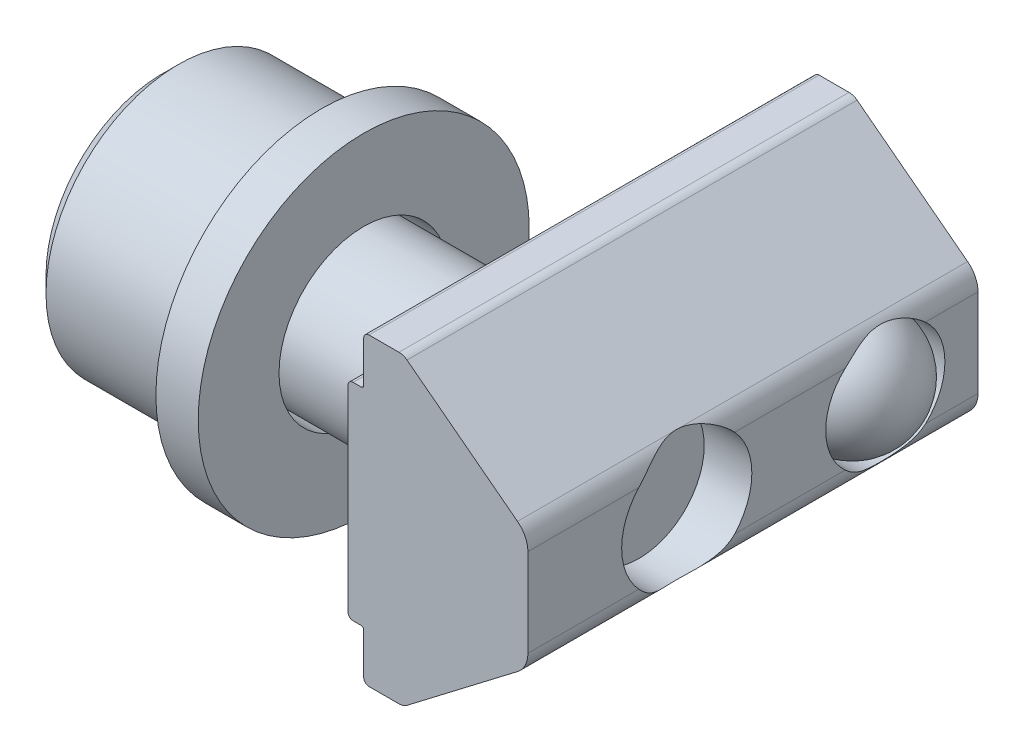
ISO-10303-21;
HEADER;
FILE_DESCRIPTION(('STEP AP214'),'2;1');
FILE_NAME('part.step','',(''),(''),'','','');
FILE_SCHEMA(('AUTOMOTIVE_DESIGN { 1 0 10303 214 1 1 1 1 }'));
ENDSEC;
DATA;
#1=APPLICATION_CONTEXT('core data for automotive mechanical design processes');
#2=APPLICATION_PROTOCOL_DEFINITION('international standard','automotive_design',2000,#1);
#3=PRODUCT_CONTEXT('',#1,'mechanical');
#4=PRODUCT('Part','Part','',(#3));
#5=PRODUCT_RELATED_PRODUCT_CATEGORY('part','',(#4));
#6=PRODUCT_DEFINITION_FORMATION('','',#4);
#7=PRODUCT_DEFINITION_CONTEXT('part definition',#1,'design');
#8=PRODUCT_DEFINITION('design','',#6,#7);
#9=PRODUCT_DEFINITION_SHAPE('','',#8);
#10=(LENGTH_UNIT() NAMED_UNIT(*) SI_UNIT(.MILLI.,.METRE.));
#11=(NAMED_UNIT(*) PLANE_ANGLE_UNIT() SI_UNIT($,.RADIAN.));
#12=(NAMED_UNIT(*) SI_UNIT($,.STERADIAN.) SOLID_ANGLE_UNIT());
#13=UNCERTAINTY_MEASURE_WITH_UNIT(LENGTH_MEASURE(1.E-05),#10,'distance_accuracy_value','');
#14=(GEOMETRIC_REPRESENTATION_CONTEXT(3) GLOBAL_UNCERTAINTY_ASSIGNED_CONTEXT((#13)) GLOBAL_UNIT_ASSIGNED_CONTEXT((#10,
#11,#12)) REPRESENTATION_CONTEXT('',''));
#15=CARTESIAN_POINT('',(0.,0.,0.));
#16=DIRECTION('',(0.,0.,1.));
#17=DIRECTION('',(1.,0.,0.));
#18=AXIS2_PLACEMENT_3D('',#15,#16,#17);
#19=CARTESIAN_POINT('',(12.2,-1.66227578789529,-11.));
#20=DIRECTION('',(1.,0.,0.));
#21=DIRECTION('',(0.,0.,-1.));
#22=AXIS2_PLACEMENT_3D('',#19,#20,#21);
#23=PLANE('',#22);
#24=CARTESIAN_POINT('',(12.2,0.,0.));
#25=DIRECTION('',(1.,0.,0.));
#26=DIRECTION('',(0.,0.,-1.));
#27=AXIS2_PLACEMENT_3D('',#24,#25,#26);
#28=CIRCLE('',#27,2.4585);
#29=CARTESIAN_POINT('',(12.2,1.66227578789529,1.81137004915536));
#30=VERTEX_POINT('',#29);
#31=CARTESIAN_POINT('',(12.2,-1.66227578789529,1.81137004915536));
#32=VERTEX_POINT('',#31);
#33=EDGE_CURVE('E287',#30,#32,#28,.T.);
#34=ORIENTED_EDGE('',*,*,#33,.F.);
#35=DIRECTION('',(0.,0.,1.));
#36=VECTOR('',#35,1.);
#37=CARTESIAN_POINT('',(12.2,1.66227578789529,-11.));
#38=LINE('',#37,#36);
#39=CARTESIAN_POINT('',(12.2,1.66227578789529,6.));
#40=VERTEX_POINT('',#39);
#41=EDGE_CURVE('E255',#30,#40,#38,.T.);
#42=ORIENTED_EDGE('',*,*,#41,.T.);
#43=DIRECTION('',(0.,1.,0.));
#44=VECTOR('',#43,1.);
#45=CARTESIAN_POINT('',(12.2,-1.66227578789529,6.));
#46=LINE('',#45,#44);
#47=CARTESIAN_POINT('',(12.2,-1.66227578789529,6.));
#48=VERTEX_POINT('',#47);
#49=EDGE_CURVE('E570',#48,#40,#46,.T.);
#50=ORIENTED_EDGE('',*,*,#49,.F.);
#51=DIRECTION('',(0.,0.,1.));
#52=VECTOR('',#51,1.);
#53=CARTESIAN_POINT('',(12.2,-1.66227578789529,-11.));
#54=LINE('',#53,#52);
#55=EDGE_CURVE('E260',#32,#48,#54,.T.);
#56=ORIENTED_EDGE('',*,*,#55,.F.);
#57=EDGE_LOOP('',(#34,#42,#50,#56));
#58=FACE_BOUND('',#57,.T.);
#59=ADVANCED_FACE('F45',(#58),#23,.T.);
#60=CARTESIAN_POINT('',(11.2,-1.66227578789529,-11.));
#61=DIRECTION('',(0.,0.,1.));
#62=DIRECTION('',(1.,0.,0.));
#63=AXIS2_PLACEMENT_3D('',#60,#61,#62);
#64=CYLINDRICAL_SURFACE('',#63,1.);
#65=CARTESIAN_POINT('',(12.2,-1.66227578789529,1.81137004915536));
#66=CARTESIAN_POINT('',(12.199996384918,-1.69359307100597,1.78263597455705));
#67=CARTESIAN_POINT('',(12.1985300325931,-1.72413511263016,1.75310638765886));
#68=CARTESIAN_POINT('',(12.1930722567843,-1.78350201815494,1.69266939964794));
#69=CARTESIAN_POINT('',(12.189084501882,-1.81232931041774,1.66176406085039));
#70=CARTESIAN_POINT('',(12.1739987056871,-1.89574713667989,1.567598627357));
#71=CARTESIAN_POINT('',(12.1597672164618,-1.94769736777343,1.5024985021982));
#72=CARTESIAN_POINT('',(12.1148588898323,-2.07457687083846,1.32609404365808));
#73=CARTESIAN_POINT('',(12.0794712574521,-2.14332710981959,1.21155033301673));
#74=CARTESIAN_POINT('',(12.0228250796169,-2.23165165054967,1.03361765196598));
#75=CARTESIAN_POINT('',(12.0033031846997,-2.25866828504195,0.973150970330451));
#76=CARTESIAN_POINT('',(11.964412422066,-2.30776403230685,0.85019345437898));
#77=CARTESIAN_POINT('',(11.9450435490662,-2.32984331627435,0.787702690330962));
#78=CARTESIAN_POINT('',(11.8973120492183,-2.38029139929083,0.6240280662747));
#79=CARTESIAN_POINT('',(11.8701821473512,-2.40497627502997,0.521257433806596));
#80=CARTESIAN_POINT('',(11.8384800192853,-2.43204750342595,0.363591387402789));
#81=CARTESIAN_POINT('',(11.8294116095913,-2.43941180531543,0.310453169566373));
#82=CARTESIAN_POINT('',(11.8151949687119,-2.45069218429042,0.203134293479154));
#83=CARTESIAN_POINT('',(11.8100591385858,-2.45459735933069,0.14895088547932));
#84=CARTESIAN_POINT('',(11.8073842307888,-2.45668399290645,0.094477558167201));
#85=B_SPLINE_CURVE_WITH_KNOTS('',3,(#65,#66,#67,#68,#69,#70,#71,#72,#73,#74,#75,#76,#77,#78,#79,
#80,#81,#82,#83,#84),.UNSPECIFIED.,.F.,.F.,(4,2,2,2,2,2,2,2,2,4),(0.,0.127415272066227,
0.254645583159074,0.507394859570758,0.919594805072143,1.12658436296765,1.33356674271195,
1.65956866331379,1.82255687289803,1.98605695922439),.UNSPECIFIED.);
#86=CARTESIAN_POINT('',(11.8073842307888,-2.45668399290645,0.0944775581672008));
#87=VERTEX_POINT('',#86);
#88=EDGE_CURVE('E288',#32,#87,#85,.T.);
#89=ORIENTED_EDGE('',*,*,#88,.F.);
#90=ORIENTED_EDGE('',*,*,#55,.T.);
#91=CARTESIAN_POINT('',(11.2,-1.66227578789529,6.));
#92=DIRECTION('',(0.,0.,1.));
#93=DIRECTION('',(1.,0.,0.));
#94=AXIS2_PLACEMENT_3D('',#91,#92,#93);
#95=CIRCLE('',#94,1.);
#96=CARTESIAN_POINT('',(11.8073842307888,-2.45668399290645,6.));
#97=VERTEX_POINT('',#96);
#98=EDGE_CURVE('E567',#97,#48,#95,.T.);
#99=ORIENTED_EDGE('',*,*,#98,.F.);
#100=DIRECTION('',(0.,0.,1.));
#101=VECTOR('',#100,1.);
#102=CARTESIAN_POINT('',(11.8073842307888,-2.45668399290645,-11.));
#103=LINE('',#102,#101);
#104=EDGE_CURVE('E478',#87,#97,#103,.T.);
#105=ORIENTED_EDGE('',*,*,#104,.F.);
#106=EDGE_LOOP('',(#89,#90,#99,#105));
#107=FACE_BOUND('',#106,.T.);
#108=ADVANCED_FACE('F391',(#107),#64,.T.);
#109=CARTESIAN_POINT('',(11.2,1.66227578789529,-11.));
#110=DIRECTION('',(0.,0.,1.));
#111=DIRECTION('',(1.,0.,0.));
#112=AXIS2_PLACEMENT_3D('',#109,#110,#111);
#113=CYLINDRICAL_SURFACE('',#112,1.);
#114=CARTESIAN_POINT('',(11.8073842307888,2.45668399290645,0.0944775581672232));
#115=CARTESIAN_POINT('',(11.8094856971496,2.45506059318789,0.136786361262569));
#116=CARTESIAN_POINT('',(11.813047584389,2.45234127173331,0.178944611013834));
#117=CARTESIAN_POINT('',(11.8226761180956,2.44478364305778,0.262707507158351));
#118=CARTESIAN_POINT('',(11.8287381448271,2.43994924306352,0.304313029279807));
#119=CARTESIAN_POINT('',(11.8500496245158,2.42238669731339,0.428018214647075));
#120=CARTESIAN_POINT('',(11.8684342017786,2.40659334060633,0.509148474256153));
#121=CARTESIAN_POINT('',(11.9069422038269,2.36997573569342,0.65763907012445));
#122=CARTESIAN_POINT('',(11.9265080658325,2.35010148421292,0.725394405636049));
#123=CARTESIAN_POINT('',(11.9669006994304,2.30476218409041,0.858629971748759));
#124=CARTESIAN_POINT('',(11.9877281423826,2.27929413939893,0.924108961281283));
#125=CARTESIAN_POINT('',(12.0494336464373,2.19456546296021,1.11706701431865));
#126=CARTESIAN_POINT('',(12.0896074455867,2.12692281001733,1.24129878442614));
#127=CARTESIAN_POINT('',(12.1451387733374,1.99414097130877,1.44120170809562));
#128=CARTESIAN_POINT('',(12.1643258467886,1.93501694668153,1.51977410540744));
#129=CARTESIAN_POINT('',(12.184891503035,1.83855728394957,1.63291363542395));
#130=CARTESIAN_POINT('',(12.1903816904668,1.80499215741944,1.66994774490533));
#131=CARTESIAN_POINT('',(12.1979358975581,1.73541392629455,1.74215040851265));
#132=CARTESIAN_POINT('',(12.1999927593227,1.69939586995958,1.77731491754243));
#133=CARTESIAN_POINT('',(12.2,1.66227578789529,1.81137004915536));
#134=B_SPLINE_CURVE_WITH_KNOTS('',3,(#114,#115,#116,#117,#118,#119,#120,#121,#122,#123,#124,
#125,#126,#127,#128,#129,#130,#131,#132,#133),.UNSPECIFIED.,.F.,.F.,(4,2,2,2,2,2,2,2,2,4),(0.,
0.127080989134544,0.253928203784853,0.507199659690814,0.72674433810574,0.946406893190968,
1.38499181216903,1.68442136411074,1.83507351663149,1.98603936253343),.UNSPECIFIED.);
#135=CARTESIAN_POINT('',(11.8073842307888,2.45668399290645,0.0944775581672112));
#136=VERTEX_POINT('',#135);
#137=EDGE_CURVE('E12',#136,#30,#134,.T.);
#138=ORIENTED_EDGE('',*,*,#137,.F.);
#139=DIRECTION('',(0.,0.,1.));
#140=VECTOR('',#139,1.);
#141=CARTESIAN_POINT('',(11.8073842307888,2.45668399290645,-11.));
#142=LINE('',#141,#140);
#143=CARTESIAN_POINT('',(11.8073842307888,2.45668399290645,6.));
#144=VERTEX_POINT('',#143);
#145=EDGE_CURVE('E238',#136,#144,#142,.T.);
#146=ORIENTED_EDGE('',*,*,#145,.T.);
#147=CARTESIAN_POINT('',(11.2,1.66227578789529,6.));
#148=DIRECTION('',(0.,0.,1.));
#149=DIRECTION('',(1.,0.,0.));
#150=AXIS2_PLACEMENT_3D('',#147,#148,#149);
#151=CIRCLE('',#150,1.);
#152=EDGE_CURVE('E571',#40,#144,#151,.T.);
#153=ORIENTED_EDGE('',*,*,#152,.F.);
#154=ORIENTED_EDGE('',*,*,#41,.F.);
#155=EDGE_LOOP('',(#138,#146,#153,#154));
#156=FACE_BOUND('',#155,.T.);
#157=ADVANCED_FACE('F389',(#156),#113,.T.);
#158=CARTESIAN_POINT('',(12.2,-1.66227578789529,-1.81137004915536));
#159=VERTEX_POINT('',#158);
#160=CARTESIAN_POINT('',(12.2,1.66227578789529,-1.81137004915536));
#161=VERTEX_POINT('',#160);
#162=EDGE_CURVE('E67',#159,#161,#28,.T.);
#163=ORIENTED_EDGE('',*,*,#162,.F.);
#164=CARTESIAN_POINT('',(12.2,-1.66227578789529,-5.9836427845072));
#165=VERTEX_POINT('',#164);
#166=EDGE_CURVE('E259',#165,#159,#54,.T.);
#167=ORIENTED_EDGE('',*,*,#166,.F.);
#168=CARTESIAN_POINT('',(12.2,0.,-7.5));
#169=DIRECTION('',(1.,0.,0.));
#170=DIRECTION('',(0.,0.,-1.));
#171=AXIS2_PLACEMENT_3D('',#168,#169,#170);
#172=CIRCLE('',#171,2.25);
#173=CARTESIAN_POINT('',(12.2,1.66227578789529,-5.9836427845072));
#174=VERTEX_POINT('',#173);
#175=EDGE_CURVE('E230',#174,#165,#172,.T.);
#176=ORIENTED_EDGE('',*,*,#175,.F.);
#177=EDGE_CURVE('E254',#174,#161,#38,.T.);
#178=ORIENTED_EDGE('',*,*,#177,.T.);
#179=EDGE_LOOP('',(#163,#167,#176,#178));
#180=FACE_BOUND('',#179,.T.);
#181=ADVANCED_FACE('F393',(#180),#23,.T.);
#182=CARTESIAN_POINT('',(11.8073842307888,-2.45668399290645,-0.0944775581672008));
#183=CARTESIAN_POINT('',(11.8094856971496,-2.45506059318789,-0.136786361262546));
#184=CARTESIAN_POINT('',(11.813047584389,-2.45234127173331,-0.178944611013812));
#185=CARTESIAN_POINT('',(11.8226761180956,-2.44478364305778,-0.262707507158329));
#186=CARTESIAN_POINT('',(11.8287381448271,-2.43994924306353,-0.304313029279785));
#187=CARTESIAN_POINT('',(11.8500496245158,-2.4223866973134,-0.428018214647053));
#188=CARTESIAN_POINT('',(11.8684342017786,-2.40659334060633,-0.509148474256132));
#189=CARTESIAN_POINT('',(11.9069422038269,-2.36997573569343,-0.657639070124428));
#190=CARTESIAN_POINT('',(11.9265080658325,-2.35010148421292,-0.725394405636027));
#191=CARTESIAN_POINT('',(11.9669006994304,-2.30476218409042,-0.858629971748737));
#192=CARTESIAN_POINT('',(11.9877281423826,-2.27929413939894,-0.924108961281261));
#193=CARTESIAN_POINT('',(12.0494336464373,-2.19456546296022,-1.11706701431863));
#194=CARTESIAN_POINT('',(12.0896074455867,-2.12692281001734,-1.24129878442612));
#195=CARTESIAN_POINT('',(12.1451387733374,-1.99414097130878,-1.4412017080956));
#196=CARTESIAN_POINT('',(12.1643258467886,-1.93501694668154,-1.51977410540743));
#197=CARTESIAN_POINT('',(12.184891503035,-1.83855728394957,-1.63291363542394));
#198=CARTESIAN_POINT('',(12.1903816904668,-1.80499215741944,-1.66994774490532));
#199=CARTESIAN_POINT('',(12.1979358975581,-1.73541392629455,-1.74215040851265));
#200=CARTESIAN_POINT('',(12.1999927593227,-1.69939586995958,-1.77731491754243));
#201=CARTESIAN_POINT('',(12.2,-1.66227578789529,-1.81137004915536));
#202=B_SPLINE_CURVE_WITH_KNOTS('',3,(#182,#183,#184,#185,#186,#187,#188,#189,#190,#191,#192,
#193,#194,#195,#196,#197,#198,#199,#200,#201),.UNSPECIFIED.,.F.,.F.,(4,2,2,2,2,2,2,2,2,4),(0.,
0.127080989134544,0.253928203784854,0.507199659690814,0.726744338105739,0.946406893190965,
1.38499181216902,1.68442136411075,1.8350735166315,1.98603936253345),.UNSPECIFIED.);
#203=CARTESIAN_POINT('',(11.8073842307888,-2.45668399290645,-0.0944775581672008));
#204=VERTEX_POINT('',#203);
#205=EDGE_CURVE('E279',#204,#159,#202,.T.);
#206=ORIENTED_EDGE('',*,*,#205,.F.);
#207=CARTESIAN_POINT('',(11.8073842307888,-2.45668399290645,-11.));
#208=VERTEX_POINT('',#207);
#209=EDGE_CURVE('E262',#208,#204,#103,.T.);
#210=ORIENTED_EDGE('',*,*,#209,.F.);
#211=CARTESIAN_POINT('',(11.2,-1.66227578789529,-11.));
#212=DIRECTION('',(0.,0.,1.));
#213=DIRECTION('',(1.,0.,0.));
#214=AXIS2_PLACEMENT_3D('',#211,#212,#213);
#215=CIRCLE('',#214,1.);
#216=CARTESIAN_POINT('',(12.2,-1.66227578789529,-11.));
#217=VERTEX_POINT('',#216);
#218=EDGE_CURVE('E414',#208,#217,#215,.T.);
#219=ORIENTED_EDGE('',*,*,#218,.T.);
#220=CARTESIAN_POINT('',(12.2,-1.66227578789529,-9.0163572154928));
#221=VERTEX_POINT('',#220);
#222=EDGE_CURVE('E256',#217,#221,#54,.T.);
#223=ORIENTED_EDGE('',*,*,#222,.T.);
#224=CARTESIAN_POINT('',(12.2,-1.66227578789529,-5.9836427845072));
#225=CARTESIAN_POINT('',(12.1999891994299,-1.69787385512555,-6.0226591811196));
#226=CARTESIAN_POINT('',(12.198101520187,-1.73204352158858,-6.06288369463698));
#227=CARTESIAN_POINT('',(12.1913841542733,-1.79731708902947,-6.14541186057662));
#228=CARTESIAN_POINT('',(12.1865595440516,-1.82842617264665,-6.18771180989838));
#229=CARTESIAN_POINT('',(12.1689129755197,-1.9168713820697,-6.31720144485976));
#230=CARTESIAN_POINT('',(12.15290971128,-1.96951420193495,-6.40718893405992));
#231=CARTESIAN_POINT('',(12.117537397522,-2.06315441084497,-6.59591432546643));
#232=CARTESIAN_POINT('',(12.0980783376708,-2.1037335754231,-6.69483840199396));
#233=CARTESIAN_POINT('',(12.0620074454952,-2.17060641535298,-6.89803059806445));
#234=CARTESIAN_POINT('',(12.0453953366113,-2.19690147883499,-7.00229819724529));
#235=CARTESIAN_POINT('',(12.0268422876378,-2.22481241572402,-7.1601674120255));
#236=CARTESIAN_POINT('',(12.0217424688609,-2.23217285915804,-7.21242518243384));
#237=CARTESIAN_POINT('',(12.0139802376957,-2.24320938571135,-7.31751762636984));
#238=CARTESIAN_POINT('',(12.0113175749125,-2.24688584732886,-7.37035224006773));
#239=CARTESIAN_POINT('',(12.0087040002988,-2.25049568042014,-7.4761570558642));
#240=CARTESIAN_POINT('',(12.0087500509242,-2.25043324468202,-7.52912703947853));
#241=CARTESIAN_POINT('',(12.0115396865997,-2.24657778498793,-7.63486015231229));
#242=CARTESIAN_POINT('',(12.0142834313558,-2.24278454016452,-7.68762326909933));
#243=CARTESIAN_POINT('',(12.0221776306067,-2.23154753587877,-7.79232728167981));
#244=CARTESIAN_POINT('',(12.0273169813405,-2.22412061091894,-7.84427083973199));
#245=CARTESIAN_POINT('',(12.0395227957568,-2.20571154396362,-7.94730169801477));
#246=CARTESIAN_POINT('',(12.0465901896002,-2.19472768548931,-7.99838857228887));
#247=CARTESIAN_POINT('',(12.0698373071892,-2.1565193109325,-8.15025517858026));
#248=CARTESIAN_POINT('',(12.0880448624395,-2.12405753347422,-8.24946242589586));
#249=CARTESIAN_POINT('',(12.1178423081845,-2.06015912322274,-8.40697213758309));
#250=CARTESIAN_POINT('',(12.1294140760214,-2.0326997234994,-8.46695078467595));
#251=CARTESIAN_POINT('',(12.1511975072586,-1.97251334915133,-8.58445562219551));
#252=CARTESIAN_POINT('',(12.161409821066,-1.93978891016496,-8.64198297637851));
#253=CARTESIAN_POINT('',(12.1790427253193,-1.86916323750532,-8.75423978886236));
#254=CARTESIAN_POINT('',(12.1864639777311,-1.8312632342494,-8.80896990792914));
#255=CARTESIAN_POINT('',(12.1969337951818,-1.75045214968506,-8.91523915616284));
#256=CARTESIAN_POINT('',(12.1999713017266,-1.70752868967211,-8.96676990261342));
#257=CARTESIAN_POINT('',(12.2000000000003,-1.66227578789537,-9.01635721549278));
#258=B_SPLINE_CURVE_WITH_KNOTS('',3,(#224,#225,#226,#227,#228,#229,#230,#231,#232,#233,#234,
#235,#236,#237,#238,#239,#240,#241,#242,#243,#244,#245,#246,#247,#248,#249,#250,#251,#252,#253,
#254,#255,#256,#257),.UNSPECIFIED.,.F.,.F.,(4,2,2,2,2,2,2,2,2,2,2,2,2,2,2,2,4),(0.,
0.15827239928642,0.316272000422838,0.631438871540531,0.956515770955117,1.2815610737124,
1.44046344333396,1.59934948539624,1.75805735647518,1.91677462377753,2.07476343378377,
2.23282859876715,2.54949468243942,2.75020547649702,2.95081989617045,3.15138670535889,
3.35245858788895),.UNSPECIFIED.);
#259=EDGE_CURVE('E75',#165,#221,#258,.T.);
#260=ORIENTED_EDGE('',*,*,#259,.F.);
#261=ORIENTED_EDGE('',*,*,#166,.T.);
#262=EDGE_LOOP('',(#206,#210,#219,#223,#260,#261));
#263=FACE_BOUND('',#262,.T.);
#264=ADVANCED_FACE('F47',(#263),#64,.T.);
#265=CARTESIAN_POINT('',(7.63444850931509,-5.64720410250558,-11.));
#266=DIRECTION('',(0.607384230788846,-0.794408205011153,0.));
#267=DIRECTION('',(0.794408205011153,0.607384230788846,0.));
#268=AXIS2_PLACEMENT_3D('',#265,#266,#267);
#269=PLANE('',#268);
#270=CARTESIAN_POINT('',(15.020523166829,0.,0.));
#271=DIRECTION('',(0.607384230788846,-0.794408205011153,0.));
#272=DIRECTION('',(-0.794408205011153,-0.607384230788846,0.));
#273=AXIS2_PLACEMENT_3D('',#270,#271,#272);
#274=ELLIPSE('',#273,4.04768493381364,2.4585);
#275=EDGE_CURVE('E286',#87,#204,#274,.T.);
#276=ORIENTED_EDGE('',*,*,#275,.F.);
#277=ORIENTED_EDGE('',*,*,#104,.T.);
#278=DIRECTION('',(0.794408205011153,0.607384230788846,0.));
#279=VECTOR('',#278,1.);
#280=CARTESIAN_POINT('',(7.63444850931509,-5.64720410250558,6.));
#281=LINE('',#280,#279);
#282=CARTESIAN_POINT('',(7.63444850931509,-5.64720410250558,6.));
#283=VERTEX_POINT('',#282);
#284=EDGE_CURVE('E419',#283,#97,#281,.T.);
#285=ORIENTED_EDGE('',*,*,#284,.F.);
#286=DIRECTION('',(0.,0.,1.));
#287=VECTOR('',#286,1.);
#288=CARTESIAN_POINT('',(7.63444850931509,-5.64720410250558,-11.));
#289=LINE('',#288,#287);
#290=CARTESIAN_POINT('',(7.63444850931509,-5.64720410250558,-11.));
#291=VERTEX_POINT('',#290);
#292=EDGE_CURVE('E479',#291,#283,#289,.T.);
#293=ORIENTED_EDGE('',*,*,#292,.F.);
#294=DIRECTION('',(0.794408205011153,0.607384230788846,0.));
#295=VECTOR('',#294,1.);
#296=CARTESIAN_POINT('',(7.63444850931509,-5.64720410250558,-11.));
#297=LINE('',#296,#295);
#298=EDGE_CURVE('E475',#291,#208,#297,.T.);
#299=ORIENTED_EDGE('',*,*,#298,.T.);
#300=ORIENTED_EDGE('',*,*,#209,.T.);
#301=EDGE_LOOP('',(#276,#277,#285,#293,#299,#300));
#302=FACE_BOUND('',#301,.T.);
#303=ADVANCED_FACE('F322',(#302),#269,.T.);
#304=CARTESIAN_POINT('',(7.33075639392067,-5.25,-11.));
#305=DIRECTION('',(0.,0.,1.));
#306=DIRECTION('',(1.,0.,0.));
#307=AXIS2_PLACEMENT_3D('',#304,#305,#306);
#308=CYLINDRICAL_SURFACE('',#307,0.499999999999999);
#309=ORIENTED_EDGE('',*,*,#292,.T.);
#310=CARTESIAN_POINT('',(7.33075639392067,-5.25,6.));
#311=DIRECTION('',(0.,0.,1.));
#312=DIRECTION('',(1.,0.,0.));
#313=AXIS2_PLACEMENT_3D('',#310,#311,#312);
#314=CIRCLE('',#313,0.499999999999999);
#315=CARTESIAN_POINT('',(7.33075639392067,-5.75,6.));
#316=VERTEX_POINT('',#315);
#317=EDGE_CURVE('E423',#316,#283,#314,.T.);
#318=ORIENTED_EDGE('',*,*,#317,.F.);
#319=DIRECTION('',(0.,0.,1.));
#320=VECTOR('',#319,1.);
#321=CARTESIAN_POINT('',(7.33075639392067,-5.75,-11.));
#322=LINE('',#321,#320);
#323=CARTESIAN_POINT('',(7.33075639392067,-5.75,-11.));
#324=VERTEX_POINT('',#323);
#325=EDGE_CURVE('E481',#324,#316,#322,.T.);
#326=ORIENTED_EDGE('',*,*,#325,.F.);
#327=CARTESIAN_POINT('',(7.33075639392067,-5.25,-11.));
#328=DIRECTION('',(0.,0.,1.));
#329=DIRECTION('',(1.,0.,0.));
#330=AXIS2_PLACEMENT_3D('',#327,#328,#329);
#331=CIRCLE('',#330,0.499999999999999);
#332=EDGE_CURVE('E472',#324,#291,#331,.T.);
#333=ORIENTED_EDGE('',*,*,#332,.T.);
#334=EDGE_LOOP('',(#309,#318,#326,#333));
#335=FACE_BOUND('',#334,.T.);
#336=ADVANCED_FACE('F325',(#335),#308,.T.);
#337=CARTESIAN_POINT('',(6.20000000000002,-5.75,-11.));
#338=DIRECTION('',(0.,-1.,0.));
#339=DIRECTION('',(1.,0.,0.));
#340=AXIS2_PLACEMENT_3D('',#337,#338,#339);
#341=PLANE('',#340);
#342=ORIENTED_EDGE('',*,*,#325,.T.);
#343=DIRECTION('',(1.,0.,0.));
#344=VECTOR('',#343,1.);
#345=CARTESIAN_POINT('',(6.20000000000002,-5.75,6.));
#346=LINE('',#345,#344);
#347=CARTESIAN_POINT('',(6.20000000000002,-5.75,6.));
#348=VERTEX_POINT('',#347);
#349=EDGE_CURVE('E556',#348,#316,#346,.T.);
#350=ORIENTED_EDGE('',*,*,#349,.F.);
#351=DIRECTION('',(0.,0.,1.));
#352=VECTOR('',#351,1.);
#353=CARTESIAN_POINT('',(6.20000000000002,-5.75,-11.));
#354=LINE('',#353,#352);
#355=CARTESIAN_POINT('',(6.20000000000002,-5.75,-11.));
#356=VERTEX_POINT('',#355);
#357=EDGE_CURVE('E483',#356,#348,#354,.T.);
#358=ORIENTED_EDGE('',*,*,#357,.F.);
#359=DIRECTION('',(1.,0.,0.));
#360=VECTOR('',#359,1.);
#361=CARTESIAN_POINT('',(6.20000000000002,-5.75,-11.));
#362=LINE('',#361,#360);
#363=EDGE_CURVE('E469',#356,#324,#362,.T.);
#364=ORIENTED_EDGE('',*,*,#363,.T.);
#365=EDGE_LOOP('',(#342,#350,#358,#364));
#366=FACE_BOUND('',#365,.T.);
#367=ADVANCED_FACE('F329',(#366),#341,.T.);
#368=CARTESIAN_POINT('',(6.20000000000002,-5.54999999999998,-11.));
#369=DIRECTION('',(0.,0.,1.));
#370=DIRECTION('',(1.,0.,0.));
#371=AXIS2_PLACEMENT_3D('',#368,#369,#370);
#372=CYLINDRICAL_SURFACE('',#371,0.200000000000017);
#373=ORIENTED_EDGE('',*,*,#357,.T.);
#374=CARTESIAN_POINT('',(6.20000000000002,-5.54999999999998,6.));
#375=DIRECTION('',(0.,0.,1.));
#376=DIRECTION('',(1.,0.,0.));
#377=AXIS2_PLACEMENT_3D('',#374,#375,#376);
#378=CIRCLE('',#377,0.200000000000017);
#379=CARTESIAN_POINT('',(6.,-5.54999999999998,6.));
#380=VERTEX_POINT('',#379);
#381=EDGE_CURVE('E553',#380,#348,#378,.T.);
#382=ORIENTED_EDGE('',*,*,#381,.F.);
#383=DIRECTION('',(0.,0.,1.));
#384=VECTOR('',#383,1.);
#385=CARTESIAN_POINT('',(6.,-5.54999999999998,-11.));
#386=LINE('',#385,#384);
#387=CARTESIAN_POINT('',(6.,-5.54999999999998,-11.));
#388=VERTEX_POINT('',#387);
#389=EDGE_CURVE('E485',#388,#380,#386,.T.);
#390=ORIENTED_EDGE('',*,*,#389,.F.);
#391=CARTESIAN_POINT('',(6.20000000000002,-5.54999999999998,-11.));
#392=DIRECTION('',(0.,0.,1.));
#393=DIRECTION('',(1.,0.,0.));
#394=AXIS2_PLACEMENT_3D('',#391,#392,#393);
#395=CIRCLE('',#394,0.200000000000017);
#396=EDGE_CURVE('E466',#388,#356,#395,.T.);
#397=ORIENTED_EDGE('',*,*,#396,.T.);
#398=EDGE_LOOP('',(#373,#382,#390,#397));
#399=FACE_BOUND('',#398,.T.);
#400=ADVANCED_FACE('F333',(#399),#372,.T.);
#401=CARTESIAN_POINT('',(6.,-4.,-11.));
#402=DIRECTION('',(-1.,0.,0.));
#403=DIRECTION('',(0.,-1.,0.));
#404=AXIS2_PLACEMENT_3D('',#401,#402,#403);
#405=PLANE('',#404);
#406=ORIENTED_EDGE('',*,*,#389,.T.);
#407=DIRECTION('',(0.,-1.,0.));
#408=VECTOR('',#407,1.);
#409=CARTESIAN_POINT('',(6.,-4.,6.));
#410=LINE('',#409,#408);
#411=CARTESIAN_POINT('',(6.,-4.,6.));
#412=VERTEX_POINT('',#411);
#413=EDGE_CURVE('E550',#412,#380,#410,.T.);
#414=ORIENTED_EDGE('',*,*,#413,.F.);
#415=DIRECTION('',(0.,0.,1.));
#416=VECTOR('',#415,1.);
#417=CARTESIAN_POINT('',(6.,-4.,-11.));
#418=LINE('',#417,#416);
#419=CARTESIAN_POINT('',(6.,-4.,-11.));
#420=VERTEX_POINT('',#419);
#421=EDGE_CURVE('E487',#420,#412,#418,.T.);
#422=ORIENTED_EDGE('',*,*,#421,.F.);
#423=DIRECTION('',(0.,-1.,0.));
#424=VECTOR('',#423,1.);
#425=CARTESIAN_POINT('',(6.,-4.,-11.));
#426=LINE('',#425,#424);
#427=EDGE_CURVE('E463',#420,#388,#426,.T.);
#428=ORIENTED_EDGE('',*,*,#427,.T.);
#429=EDGE_LOOP('',(#406,#414,#422,#428));
#430=FACE_BOUND('',#429,.T.);
#431=ADVANCED_FACE('F337',(#430),#405,.T.);
#432=CARTESIAN_POINT('',(5.9,-4.,-11.));
#433=DIRECTION('',(0.,0.,1.));
#434=DIRECTION('',(1.,0.,0.));
#435=AXIS2_PLACEMENT_3D('',#432,#433,#434);
#436=CYLINDRICAL_SURFACE('',#435,0.0999999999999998);
#437=ORIENTED_EDGE('',*,*,#421,.T.);
#438=CARTESIAN_POINT('',(5.9,-4.,6.));
#439=DIRECTION('',(0.,0.,-1.));
#440=DIRECTION('',(1.,0.,0.));
#441=AXIS2_PLACEMENT_3D('',#438,#439,#440);
#442=CIRCLE('',#441,0.0999999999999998);
#443=CARTESIAN_POINT('',(5.9,-3.9,6.));
#444=VERTEX_POINT('',#443);
#445=EDGE_CURVE('E547',#444,#412,#442,.T.);
#446=ORIENTED_EDGE('',*,*,#445,.F.);
#447=DIRECTION('',(0.,0.,1.));
#448=VECTOR('',#447,1.);
#449=CARTESIAN_POINT('',(5.9,-3.9,-11.));
#450=LINE('',#449,#448);
#451=CARTESIAN_POINT('',(5.9,-3.9,-11.));
#452=VERTEX_POINT('',#451);
#453=EDGE_CURVE('E489',#452,#444,#450,.T.);
#454=ORIENTED_EDGE('',*,*,#453,.F.);
#455=CARTESIAN_POINT('',(5.9,-4.,-11.));
#456=DIRECTION('',(0.,0.,-1.));
#457=DIRECTION('',(1.,0.,0.));
#458=AXIS2_PLACEMENT_3D('',#455,#456,#457);
#459=CIRCLE('',#458,0.0999999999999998);
#460=EDGE_CURVE('E460',#452,#420,#459,.T.);
#461=ORIENTED_EDGE('',*,*,#460,.T.);
#462=EDGE_LOOP('',(#437,#446,#454,#461));
#463=FACE_BOUND('',#462,.T.);
#464=ADVANCED_FACE('F341',(#463),#436,.F.);
#465=CARTESIAN_POINT('',(5.60000000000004,-3.9,-11.));
#466=DIRECTION('',(0.,-1.,0.));
#467=DIRECTION('',(0.,0.,-1.));
#468=AXIS2_PLACEMENT_3D('',#465,#466,#467);
#469=PLANE('',#468);
#470=ORIENTED_EDGE('',*,*,#453,.T.);
#471=DIRECTION('',(1.,0.,0.));
#472=VECTOR('',#471,1.);
#473=CARTESIAN_POINT('',(5.60000000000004,-3.9,6.));
#474=LINE('',#473,#472);
#475=CARTESIAN_POINT('',(5.60000000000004,-3.9,6.));
#476=VERTEX_POINT('',#475);
#477=EDGE_CURVE('E544',#476,#444,#474,.T.);
#478=ORIENTED_EDGE('',*,*,#477,.F.);
#479=DIRECTION('',(0.,0.,1.));
#480=VECTOR('',#479,1.);
#481=CARTESIAN_POINT('',(5.60000000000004,-3.9,-11.));
#482=LINE('',#481,#480);
#483=CARTESIAN_POINT('',(5.60000000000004,-3.9,-11.));
#484=VERTEX_POINT('',#483);
#485=EDGE_CURVE('E491',#484,#476,#482,.T.);
#486=ORIENTED_EDGE('',*,*,#485,.F.);
#487=DIRECTION('',(1.,0.,0.));
#488=VECTOR('',#487,1.);
#489=CARTESIAN_POINT('',(5.60000000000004,-3.9,-11.));
#490=LINE('',#489,#488);
#491=EDGE_CURVE('E457',#484,#452,#490,.T.);
#492=ORIENTED_EDGE('',*,*,#491,.T.);
#493=EDGE_LOOP('',(#470,#478,#486,#492));
#494=FACE_BOUND('',#493,.T.);
#495=ADVANCED_FACE('F345',(#494),#469,.T.);
#496=CARTESIAN_POINT('',(5.60000000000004,-3.69999999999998,-11.));
#497=DIRECTION('',(0.,0.,1.));
#498=DIRECTION('',(1.,0.,0.));
#499=AXIS2_PLACEMENT_3D('',#496,#497,#498);
#500=CYLINDRICAL_SURFACE('',#499,0.200000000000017);
#501=ORIENTED_EDGE('',*,*,#485,.T.);
#502=CARTESIAN_POINT('',(5.60000000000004,-3.69999999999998,6.));
#503=DIRECTION('',(0.,0.,1.));
#504=DIRECTION('',(1.,0.,0.));
#505=AXIS2_PLACEMENT_3D('',#502,#503,#504);
#506=CIRCLE('',#505,0.200000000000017);
#507=CARTESIAN_POINT('',(5.40000000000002,-3.69999999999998,6.));
#508=VERTEX_POINT('',#507);
#509=EDGE_CURVE('E541',#508,#476,#506,.T.);
#510=ORIENTED_EDGE('',*,*,#509,.F.);
#511=DIRECTION('',(0.,0.,1.));
#512=VECTOR('',#511,1.);
#513=CARTESIAN_POINT('',(5.40000000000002,-3.69999999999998,-11.));
#514=LINE('',#513,#512);
#515=CARTESIAN_POINT('',(5.40000000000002,-3.69999999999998,-11.));
#516=VERTEX_POINT('',#515);
#517=EDGE_CURVE('E493',#516,#508,#514,.T.);
#518=ORIENTED_EDGE('',*,*,#517,.F.);
#519=CARTESIAN_POINT('',(5.60000000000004,-3.69999999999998,-11.));
#520=DIRECTION('',(0.,0.,1.));
#521=DIRECTION('',(1.,0.,0.));
#522=AXIS2_PLACEMENT_3D('',#519,#520,#521);
#523=CIRCLE('',#522,0.200000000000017);
#524=EDGE_CURVE('E454',#516,#484,#523,.T.);
#525=ORIENTED_EDGE('',*,*,#524,.T.);
#526=EDGE_LOOP('',(#501,#510,#518,#525));
#527=FACE_BOUND('',#526,.T.);
#528=ADVANCED_FACE('F349',(#527),#500,.T.);
#529=CARTESIAN_POINT('',(5.40000000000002,3.69999999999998,-11.));
#530=DIRECTION('',(-1.,0.,0.));
#531=DIRECTION('',(0.,-1.,0.));
#532=AXIS2_PLACEMENT_3D('',#529,#530,#531);
#533=PLANE('',#532);
#534=CARTESIAN_POINT('',(5.40000000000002,0.,0.));
#535=DIRECTION('',(-1.,0.,0.));
#536=DIRECTION('',(0.,0.,1.));
#537=AXIS2_PLACEMENT_3D('',#534,#535,#536);
#538=CIRCLE('',#537,2.4585);
#539=CARTESIAN_POINT('',(5.40000000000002,0.,2.4585));
#540=VERTEX_POINT('',#539);
#541=EDGE_CURVE('E239',#540,#540,#538,.T.);
#542=ORIENTED_EDGE('',*,*,#541,.F.);
#543=EDGE_LOOP('',(#542));
#544=FACE_BOUND('',#543,.T.);
#545=ORIENTED_EDGE('',*,*,#517,.T.);
#546=DIRECTION('',(0.,-1.,0.));
#547=VECTOR('',#546,1.);
#548=CARTESIAN_POINT('',(5.40000000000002,3.69999999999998,6.));
#549=LINE('',#548,#547);
#550=CARTESIAN_POINT('',(5.40000000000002,3.69999999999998,6.));
#551=VERTEX_POINT('',#550);
#552=EDGE_CURVE('E538',#551,#508,#549,.T.);
#553=ORIENTED_EDGE('',*,*,#552,.F.);
#554=DIRECTION('',(0.,0.,1.));
#555=VECTOR('',#554,1.);
#556=CARTESIAN_POINT('',(5.40000000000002,3.69999999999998,-11.));
#557=LINE('',#556,#555);
#558=CARTESIAN_POINT('',(5.40000000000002,3.69999999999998,-11.));
#559=VERTEX_POINT('',#558);
#560=EDGE_CURVE('E495',#559,#551,#557,.T.);
#561=ORIENTED_EDGE('',*,*,#560,.F.);
#562=DIRECTION('',(0.,-1.,0.));
#563=VECTOR('',#562,1.);
#564=CARTESIAN_POINT('',(5.40000000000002,3.69999999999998,-11.));
#565=LINE('',#564,#563);
#566=EDGE_CURVE('E451',#559,#516,#565,.T.);
#567=ORIENTED_EDGE('',*,*,#566,.T.);
#568=EDGE_LOOP('',(#545,#553,#561,#567));
#569=FACE_BOUND('',#568,.T.);
#570=ADVANCED_FACE('F353',(#544,#569),#533,.T.);
#571=CARTESIAN_POINT('',(5.60000000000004,3.69999999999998,-11.));
#572=DIRECTION('',(0.,0.,1.));
#573=DIRECTION('',(1.,0.,0.));
#574=AXIS2_PLACEMENT_3D('',#571,#572,#573);
#575=CYLINDRICAL_SURFACE('',#574,0.200000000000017);
#576=ORIENTED_EDGE('',*,*,#560,.T.);
#577=CARTESIAN_POINT('',(5.60000000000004,3.69999999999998,6.));
#578=DIRECTION('',(0.,0.,1.));
#579=DIRECTION('',(1.,0.,0.));
#580=AXIS2_PLACEMENT_3D('',#577,#578,#579);
#581=CIRCLE('',#580,0.200000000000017);
#582=CARTESIAN_POINT('',(5.60000000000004,3.9,6.));
#583=VERTEX_POINT('',#582);
#584=EDGE_CURVE('E535',#583,#551,#581,.T.);
#585=ORIENTED_EDGE('',*,*,#584,.F.);
#586=DIRECTION('',(0.,0.,1.));
#587=VECTOR('',#586,1.);
#588=CARTESIAN_POINT('',(5.60000000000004,3.9,-11.));
#589=LINE('',#588,#587);
#590=CARTESIAN_POINT('',(5.60000000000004,3.9,-11.));
#591=VERTEX_POINT('',#590);
#592=EDGE_CURVE('E497',#591,#583,#589,.T.);
#593=ORIENTED_EDGE('',*,*,#592,.F.);
#594=CARTESIAN_POINT('',(5.60000000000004,3.69999999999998,-11.));
#595=DIRECTION('',(0.,0.,1.));
#596=DIRECTION('',(1.,0.,0.));
#597=AXIS2_PLACEMENT_3D('',#594,#595,#596);
#598=CIRCLE('',#597,0.200000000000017);
#599=EDGE_CURVE('E448',#591,#559,#598,.T.);
#600=ORIENTED_EDGE('',*,*,#599,.T.);
#601=EDGE_LOOP('',(#576,#585,#593,#600));
#602=FACE_BOUND('',#601,.T.);
#603=ADVANCED_FACE('F357',(#602),#575,.T.);
#604=CARTESIAN_POINT('',(5.9,3.9,-11.));
#605=DIRECTION('',(0.,1.,0.));
#606=DIRECTION('',(-1.,0.,0.));
#607=AXIS2_PLACEMENT_3D('',#604,#605,#606);
#608=PLANE('',#607);
#609=ORIENTED_EDGE('',*,*,#592,.T.);
#610=DIRECTION('',(-1.,0.,0.));
#611=VECTOR('',#610,1.);
#612=CARTESIAN_POINT('',(5.9,3.9,6.));
#613=LINE('',#612,#611);
#614=CARTESIAN_POINT('',(5.9,3.9,6.));
#615=VERTEX_POINT('',#614);
#616=EDGE_CURVE('E532',#615,#583,#613,.T.);
#617=ORIENTED_EDGE('',*,*,#616,.F.);
#618=DIRECTION('',(0.,0.,1.));
#619=VECTOR('',#618,1.);
#620=CARTESIAN_POINT('',(5.9,3.9,-11.));
#621=LINE('',#620,#619);
#622=CARTESIAN_POINT('',(5.9,3.9,-11.));
#623=VERTEX_POINT('',#622);
#624=EDGE_CURVE('E499',#623,#615,#621,.T.);
#625=ORIENTED_EDGE('',*,*,#624,.F.);
#626=DIRECTION('',(-1.,0.,0.));
#627=VECTOR('',#626,1.);
#628=CARTESIAN_POINT('',(5.9,3.9,-11.));
#629=LINE('',#628,#627);
#630=EDGE_CURVE('E445',#623,#591,#629,.T.);
#631=ORIENTED_EDGE('',*,*,#630,.T.);
#632=EDGE_LOOP('',(#609,#617,#625,#631));
#633=FACE_BOUND('',#632,.T.);
#634=ADVANCED_FACE('F361',(#633),#608,.T.);
#635=CARTESIAN_POINT('',(5.9,4.,-11.));
#636=DIRECTION('',(0.,0.,1.));
#637=DIRECTION('',(1.,0.,0.));
#638=AXIS2_PLACEMENT_3D('',#635,#636,#637);
#639=CYLINDRICAL_SURFACE('',#638,0.0999999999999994);
#640=ORIENTED_EDGE('',*,*,#624,.T.);
#641=CARTESIAN_POINT('',(5.9,4.,6.));
#642=DIRECTION('',(0.,0.,-1.));
#643=DIRECTION('',(1.,0.,0.));
#644=AXIS2_PLACEMENT_3D('',#641,#642,#643);
#645=CIRCLE('',#644,0.0999999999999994);
#646=CARTESIAN_POINT('',(6.,4.,6.));
#647=VERTEX_POINT('',#646);
#648=EDGE_CURVE('E529',#647,#615,#645,.T.);
#649=ORIENTED_EDGE('',*,*,#648,.F.);
#650=DIRECTION('',(0.,0.,1.));
#651=VECTOR('',#650,1.);
#652=CARTESIAN_POINT('',(6.,4.,-11.));
#653=LINE('',#652,#651);
#654=CARTESIAN_POINT('',(6.,4.,-11.));
#655=VERTEX_POINT('',#654);
#656=EDGE_CURVE('E501',#655,#647,#653,.T.);
#657=ORIENTED_EDGE('',*,*,#656,.F.);
#658=CARTESIAN_POINT('',(5.9,4.,-11.));
#659=DIRECTION('',(0.,0.,-1.));
#660=DIRECTION('',(1.,0.,0.));
#661=AXIS2_PLACEMENT_3D('',#658,#659,#660);
#662=CIRCLE('',#661,0.0999999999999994);
#663=EDGE_CURVE('E442',#655,#623,#662,.T.);
#664=ORIENTED_EDGE('',*,*,#663,.T.);
#665=EDGE_LOOP('',(#640,#649,#657,#664));
#666=FACE_BOUND('',#665,.T.);
#667=ADVANCED_FACE('F365',(#666),#639,.F.);
#668=CARTESIAN_POINT('',(6.,5.54999999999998,-11.));
#669=DIRECTION('',(-1.,0.,0.));
#670=DIRECTION('',(0.,0.,1.));
#671=AXIS2_PLACEMENT_3D('',#668,#669,#670);
#672=PLANE('',#671);
#673=ORIENTED_EDGE('',*,*,#656,.T.);
#674=DIRECTION('',(0.,-1.,0.));
#675=VECTOR('',#674,1.);
#676=CARTESIAN_POINT('',(6.,5.54999999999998,6.));
#677=LINE('',#676,#675);
#678=CARTESIAN_POINT('',(6.,5.54999999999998,6.));
#679=VERTEX_POINT('',#678);
#680=EDGE_CURVE('E523',#679,#647,#677,.T.);
#681=ORIENTED_EDGE('',*,*,#680,.F.);
#682=DIRECTION('',(0.,0.,1.));
#683=VECTOR('',#682,1.);
#684=CARTESIAN_POINT('',(6.,5.54999999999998,-11.));
#685=LINE('',#684,#683);
#686=CARTESIAN_POINT('',(6.,5.54999999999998,-11.));
#687=VERTEX_POINT('',#686);
#688=EDGE_CURVE('E503',#687,#679,#685,.T.);
#689=ORIENTED_EDGE('',*,*,#688,.F.);
#690=DIRECTION('',(0.,-1.,0.));
#691=VECTOR('',#690,1.);
#692=CARTESIAN_POINT('',(6.,5.54999999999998,-11.));
#693=LINE('',#692,#691);
#694=EDGE_CURVE('E439',#687,#655,#693,.T.);
#695=ORIENTED_EDGE('',*,*,#694,.T.);
#696=EDGE_LOOP('',(#673,#681,#689,#695));
#697=FACE_BOUND('',#696,.T.);
#698=ADVANCED_FACE('F369',(#697),#672,.T.);
#699=CARTESIAN_POINT('',(6.20000000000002,5.54999999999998,-11.));
#700=DIRECTION('',(0.,0.,1.));
#701=DIRECTION('',(1.,0.,0.));
#702=AXIS2_PLACEMENT_3D('',#699,#700,#701);
#703=CYLINDRICAL_SURFACE('',#702,0.200000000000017);
#704=ORIENTED_EDGE('',*,*,#688,.T.);
#705=CARTESIAN_POINT('',(6.20000000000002,5.54999999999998,6.));
#706=DIRECTION('',(0.,0.,1.));
#707=DIRECTION('',(1.,0.,0.));
#708=AXIS2_PLACEMENT_3D('',#705,#706,#707);
#709=CIRCLE('',#708,0.200000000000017);
#710=CARTESIAN_POINT('',(6.20000000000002,5.75,6.));
#711=VERTEX_POINT('',#710);
#712=EDGE_CURVE('E521',#711,#679,#709,.T.);
#713=ORIENTED_EDGE('',*,*,#712,.F.);
#714=DIRECTION('',(0.,0.,1.));
#715=VECTOR('',#714,1.);
#716=CARTESIAN_POINT('',(6.20000000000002,5.75,-11.));
#717=LINE('',#716,#715);
#718=CARTESIAN_POINT('',(6.20000000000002,5.75,-11.));
#719=VERTEX_POINT('',#718);
#720=EDGE_CURVE('E505',#719,#711,#717,.T.);
#721=ORIENTED_EDGE('',*,*,#720,.F.);
#722=CARTESIAN_POINT('',(6.20000000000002,5.54999999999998,-11.));
#723=DIRECTION('',(0.,0.,1.));
#724=DIRECTION('',(1.,0.,0.));
#725=AXIS2_PLACEMENT_3D('',#722,#723,#724);
#726=CIRCLE('',#725,0.200000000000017);
#727=EDGE_CURVE('E436',#719,#687,#726,.T.);
#728=ORIENTED_EDGE('',*,*,#727,.T.);
#729=EDGE_LOOP('',(#704,#713,#721,#728));
#730=FACE_BOUND('',#729,.T.);
#731=ADVANCED_FACE('F373',(#730),#703,.T.);
#732=CARTESIAN_POINT('',(7.33075639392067,5.75,-11.));
#733=DIRECTION('',(0.,1.,0.));
#734=DIRECTION('',(-1.,0.,0.));
#735=AXIS2_PLACEMENT_3D('',#732,#733,#734);
#736=PLANE('',#735);
#737=ORIENTED_EDGE('',*,*,#720,.T.);
#738=DIRECTION('',(-1.,0.,0.));
#739=VECTOR('',#738,1.);
#740=CARTESIAN_POINT('',(7.33075639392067,5.75,6.));
#741=LINE('',#740,#739);
#742=CARTESIAN_POINT('',(7.33075639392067,5.75,6.));
#743=VERTEX_POINT('',#742);
#744=EDGE_CURVE('E516',#743,#711,#741,.T.);
#745=ORIENTED_EDGE('',*,*,#744,.F.);
#746=DIRECTION('',(0.,0.,1.));
#747=VECTOR('',#746,1.);
#748=CARTESIAN_POINT('',(7.33075639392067,5.75,-11.));
#749=LINE('',#748,#747);
#750=CARTESIAN_POINT('',(7.33075639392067,5.75,-11.));
#751=VERTEX_POINT('',#750);
#752=EDGE_CURVE('E247',#751,#743,#749,.T.);
#753=ORIENTED_EDGE('',*,*,#752,.F.);
#754=DIRECTION('',(-1.,0.,0.));
#755=VECTOR('',#754,1.);
#756=CARTESIAN_POINT('',(7.33075639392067,5.75,-11.));
#757=LINE('',#756,#755);
#758=EDGE_CURVE('E433',#751,#719,#757,.T.);
#759=ORIENTED_EDGE('',*,*,#758,.T.);
#760=EDGE_LOOP('',(#737,#745,#753,#759));
#761=FACE_BOUND('',#760,.T.);
#762=ADVANCED_FACE('F377',(#761),#736,.T.);
#763=CARTESIAN_POINT('',(7.33075639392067,5.25,-11.));
#764=DIRECTION('',(0.,0.,1.));
#765=DIRECTION('',(1.,0.,0.));
#766=AXIS2_PLACEMENT_3D('',#763,#764,#765);
#767=CYLINDRICAL_SURFACE('',#766,0.499999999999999);
#768=ORIENTED_EDGE('',*,*,#752,.T.);
#769=CARTESIAN_POINT('',(7.33075639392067,5.25,6.));
#770=DIRECTION('',(0.,0.,1.));
#771=DIRECTION('',(1.,0.,0.));
#772=AXIS2_PLACEMENT_3D('',#769,#770,#771);
#773=CIRCLE('',#772,0.499999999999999);
#774=CARTESIAN_POINT('',(7.63444850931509,5.64720410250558,6.));
#775=VERTEX_POINT('',#774);
#776=EDGE_CURVE('E508',#775,#743,#773,.T.);
#777=ORIENTED_EDGE('',*,*,#776,.F.);
#778=DIRECTION('',(0.,0.,1.));
#779=VECTOR('',#778,1.);
#780=CARTESIAN_POINT('',(7.63444850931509,5.64720410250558,-11.));
#781=LINE('',#780,#779);
#782=CARTESIAN_POINT('',(7.63444850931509,5.64720410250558,-11.));
#783=VERTEX_POINT('',#782);
#784=EDGE_CURVE('E245',#783,#775,#781,.T.);
#785=ORIENTED_EDGE('',*,*,#784,.F.);
#786=CARTESIAN_POINT('',(7.33075639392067,5.25,-11.));
#787=DIRECTION('',(0.,0.,1.));
#788=DIRECTION('',(1.,0.,0.));
#789=AXIS2_PLACEMENT_3D('',#786,#787,#788);
#790=CIRCLE('',#789,0.499999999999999);
#791=EDGE_CURVE('E430',#783,#751,#790,.T.);
#792=ORIENTED_EDGE('',*,*,#791,.T.);
#793=EDGE_LOOP('',(#768,#777,#785,#792));
#794=FACE_BOUND('',#793,.T.);
#795=ADVANCED_FACE('F381',(#794),#767,.T.);
#796=CARTESIAN_POINT('',(11.8073842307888,2.45668399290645,-11.));
#797=DIRECTION('',(0.607384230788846,0.794408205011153,0.));
#798=DIRECTION('',(-0.794408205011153,0.607384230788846,0.));
#799=AXIS2_PLACEMENT_3D('',#796,#797,#798);
#800=PLANE('',#799);
#801=CARTESIAN_POINT('',(15.020523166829,0.,0.));
#802=DIRECTION('',(0.607384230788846,0.794408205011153,0.));
#803=DIRECTION('',(-0.794408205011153,0.607384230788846,0.));
#804=AXIS2_PLACEMENT_3D('',#801,#802,#803);
#805=ELLIPSE('',#804,4.04768493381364,2.4585);
#806=CARTESIAN_POINT('',(11.8073842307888,2.45668399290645,-0.0944775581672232));
#807=VERTEX_POINT('',#806);
#808=EDGE_CURVE('E224',#807,#136,#805,.T.);
#809=ORIENTED_EDGE('',*,*,#808,.F.);
#810=CARTESIAN_POINT('',(11.8073842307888,2.45668399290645,-11.));
#811=VERTEX_POINT('',#810);
#812=EDGE_CURVE('E235',#811,#807,#142,.T.);
#813=ORIENTED_EDGE('',*,*,#812,.F.);
#814=DIRECTION('',(-0.794408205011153,0.607384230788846,0.));
#815=VECTOR('',#814,1.);
#816=CARTESIAN_POINT('',(11.8073842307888,2.45668399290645,-11.));
#817=LINE('',#816,#815);
#818=EDGE_CURVE('E428',#811,#783,#817,.T.);
#819=ORIENTED_EDGE('',*,*,#818,.T.);
#820=ORIENTED_EDGE('',*,*,#784,.T.);
#821=DIRECTION('',(-0.794408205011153,0.607384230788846,0.));
#822=VECTOR('',#821,1.);
#823=CARTESIAN_POINT('',(11.8073842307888,2.45668399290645,6.));
#824=LINE('',#823,#822);
#825=EDGE_CURVE('E519',#144,#775,#824,.T.);
#826=ORIENTED_EDGE('',*,*,#825,.F.);
#827=ORIENTED_EDGE('',*,*,#145,.F.);
#828=EDGE_LOOP('',(#809,#813,#819,#820,#826,#827));
#829=FACE_BOUND('',#828,.T.);
#830=ADVANCED_FACE('F233',(#829),#800,.T.);
#831=CARTESIAN_POINT('',(12.2,1.66227578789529,-1.81137004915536));
#832=CARTESIAN_POINT('',(12.199996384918,1.69359307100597,-1.78263597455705));
#833=CARTESIAN_POINT('',(12.1985300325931,1.72413511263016,-1.75310638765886));
#834=CARTESIAN_POINT('',(12.1930722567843,1.78350201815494,-1.69266939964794));
#835=CARTESIAN_POINT('',(12.189084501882,1.81232931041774,-1.66176406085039));
#836=CARTESIAN_POINT('',(12.1739987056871,1.89574713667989,-1.567598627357));
#837=CARTESIAN_POINT('',(12.1597672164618,1.94769736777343,-1.5024985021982));
#838=CARTESIAN_POINT('',(12.1148588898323,2.07457687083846,-1.32609404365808));
#839=CARTESIAN_POINT('',(12.0794712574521,2.14332710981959,-1.21155033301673));
#840=CARTESIAN_POINT('',(12.0228250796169,2.23165165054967,-1.03361765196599));
#841=CARTESIAN_POINT('',(12.0033031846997,2.25866828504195,-0.973150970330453));
#842=CARTESIAN_POINT('',(11.964412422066,2.30776403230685,-0.850193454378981));
#843=CARTESIAN_POINT('',(11.9450435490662,2.32984331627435,-0.787702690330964));
#844=CARTESIAN_POINT('',(11.8973120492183,2.38029139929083,-0.624028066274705));
#845=CARTESIAN_POINT('',(11.8701821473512,2.40497627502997,-0.521257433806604));
#846=CARTESIAN_POINT('',(11.8384800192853,2.43204750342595,-0.363591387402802));
#847=CARTESIAN_POINT('',(11.8294116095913,2.43941180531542,-0.310453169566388));
#848=CARTESIAN_POINT('',(11.8151949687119,2.45069218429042,-0.203134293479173));
#849=CARTESIAN_POINT('',(11.8100591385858,2.45459735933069,-0.14895088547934));
#850=CARTESIAN_POINT('',(11.8073842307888,2.45668399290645,-0.0944775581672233));
#851=B_SPLINE_CURVE_WITH_KNOTS('',3,(#831,#832,#833,#834,#835,#836,#837,#838,#839,#840,#841,
#842,#843,#844,#845,#846,#847,#848,#849,#850),.UNSPECIFIED.,.F.,.F.,(4,2,2,2,2,2,2,2,2,4),(0.,
0.127415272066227,0.254645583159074,0.507394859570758,0.919594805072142,1.12658436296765,
1.33356674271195,1.65956866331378,1.82255687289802,1.98605695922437),.UNSPECIFIED.);
#852=EDGE_CURVE('E60',#161,#807,#851,.T.);
#853=ORIENTED_EDGE('',*,*,#852,.F.);
#854=ORIENTED_EDGE('',*,*,#177,.F.);
#855=CARTESIAN_POINT('',(12.2,1.66227578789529,-9.0163572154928));
#856=CARTESIAN_POINT('',(12.1999891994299,1.69787385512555,-8.9773408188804));
#857=CARTESIAN_POINT('',(12.198101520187,1.73204352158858,-8.93711630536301));
#858=CARTESIAN_POINT('',(12.1913841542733,1.79731708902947,-8.85458813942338));
#859=CARTESIAN_POINT('',(12.1865595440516,1.82842617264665,-8.81228819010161));
#860=CARTESIAN_POINT('',(12.1689129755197,1.9168713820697,-8.68279855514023));
#861=CARTESIAN_POINT('',(12.15290971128,1.96951420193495,-8.59281106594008));
#862=CARTESIAN_POINT('',(12.117537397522,2.06315441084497,-8.40408567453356));
#863=CARTESIAN_POINT('',(12.0980783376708,2.1037335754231,-8.30516159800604));
#864=CARTESIAN_POINT('',(12.0620074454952,2.17060641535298,-8.10196940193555));
#865=CARTESIAN_POINT('',(12.0453953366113,2.19690147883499,-7.9977018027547));
#866=CARTESIAN_POINT('',(12.0268422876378,2.22481241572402,-7.8398325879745));
#867=CARTESIAN_POINT('',(12.0217424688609,2.23217285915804,-7.78757481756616));
#868=CARTESIAN_POINT('',(12.0139802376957,2.24320938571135,-7.68248237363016));
#869=CARTESIAN_POINT('',(12.0113175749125,2.24688584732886,-7.62964775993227));
#870=CARTESIAN_POINT('',(12.0087040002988,2.25049568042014,-7.52384294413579));
#871=CARTESIAN_POINT('',(12.0087500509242,2.25043324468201,-7.47087296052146));
#872=CARTESIAN_POINT('',(12.0115396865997,2.24657778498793,-7.36513984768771));
#873=CARTESIAN_POINT('',(12.0142834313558,2.24278454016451,-7.31237673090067));
#874=CARTESIAN_POINT('',(12.0221776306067,2.23154753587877,-7.20767271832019));
#875=CARTESIAN_POINT('',(12.0273169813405,2.22412061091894,-7.15572916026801));
#876=CARTESIAN_POINT('',(12.0395227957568,2.20571154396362,-7.05269830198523));
#877=CARTESIAN_POINT('',(12.0465901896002,2.19472768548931,-7.00161142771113));
#878=CARTESIAN_POINT('',(12.0698373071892,2.15651931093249,-6.84974482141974));
#879=CARTESIAN_POINT('',(12.0880448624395,2.12405753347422,-6.75053757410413));
#880=CARTESIAN_POINT('',(12.1178423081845,2.06015912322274,-6.59302786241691));
#881=CARTESIAN_POINT('',(12.1294140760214,2.03269972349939,-6.53304921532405));
#882=CARTESIAN_POINT('',(12.1511975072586,1.97251334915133,-6.41554437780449));
#883=CARTESIAN_POINT('',(12.161409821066,1.93978891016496,-6.35801702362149));
#884=CARTESIAN_POINT('',(12.1790427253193,1.86916323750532,-6.24576021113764));
#885=CARTESIAN_POINT('',(12.1864639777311,1.8312632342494,-6.19103009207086));
#886=CARTESIAN_POINT('',(12.1969337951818,1.75045214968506,-6.08476084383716));
#887=CARTESIAN_POINT('',(12.1999713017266,1.70752868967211,-6.03323009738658));
#888=CARTESIAN_POINT('',(12.2000000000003,1.66227578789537,-5.98364278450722));
#889=B_SPLINE_CURVE_WITH_KNOTS('',3,(#855,#856,#857,#858,#859,#860,#861,#862,#863,#864,#865,
#866,#867,#868,#869,#870,#871,#872,#873,#874,#875,#876,#877,#878,#879,#880,#881,#882,#883,#884,
#885,#886,#887,#888),.UNSPECIFIED.,.F.,.F.,(4,2,2,2,2,2,2,2,2,2,2,2,2,2,2,2,4),(0.,
0.158272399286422,0.316272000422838,0.631438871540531,0.956515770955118,1.2815610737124,
1.44046344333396,1.59934948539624,1.75805735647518,1.91677462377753,2.07476343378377,
2.23282859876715,2.54949468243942,2.75020547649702,2.95081989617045,3.15138670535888,
3.35245858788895),.UNSPECIFIED.);
#890=CARTESIAN_POINT('',(12.2,1.66227578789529,-9.0163572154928));
#891=VERTEX_POINT('',#890);
#892=EDGE_CURVE('E297',#891,#174,#889,.T.);
#893=ORIENTED_EDGE('',*,*,#892,.F.);
#894=CARTESIAN_POINT('',(12.2,1.66227578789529,-11.));
#895=VERTEX_POINT('',#894);
#896=EDGE_CURVE('E249',#895,#891,#38,.T.);
#897=ORIENTED_EDGE('',*,*,#896,.F.);
#898=CARTESIAN_POINT('',(11.2,1.66227578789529,-11.));
#899=DIRECTION('',(0.,0.,1.));
#900=DIRECTION('',(1.,0.,0.));
#901=AXIS2_PLACEMENT_3D('',#898,#899,#900);
#902=CIRCLE('',#901,1.);
#903=EDGE_CURVE('E244',#895,#811,#902,.T.);
#904=ORIENTED_EDGE('',*,*,#903,.T.);
#905=ORIENTED_EDGE('',*,*,#812,.T.);
#906=EDGE_LOOP('',(#853,#854,#893,#897,#904,#905));
#907=FACE_BOUND('',#906,.T.);
#908=ADVANCED_FACE('F242',(#907),#113,.T.);
#909=EDGE_CURVE('E261',#221,#891,#172,.T.);
#910=ORIENTED_EDGE('',*,*,#909,.F.);
#911=ORIENTED_EDGE('',*,*,#222,.F.);
#912=DIRECTION('',(0.,1.,0.));
#913=VECTOR('',#912,1.);
#914=CARTESIAN_POINT('',(12.2,-1.66227578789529,-11.));
#915=LINE('',#914,#913);
#916=EDGE_CURVE('E418',#217,#895,#915,.T.);
#917=ORIENTED_EDGE('',*,*,#916,.T.);
#918=ORIENTED_EDGE('',*,*,#896,.T.);
#919=EDGE_LOOP('',(#910,#911,#917,#918));
#920=FACE_BOUND('',#919,.T.);
#921=ADVANCED_FACE('F320',(#920),#23,.T.);
#922=CARTESIAN_POINT('',(11.2,-1.66227578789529,-11.));
#923=DIRECTION('',(0.,0.,1.));
#924=DIRECTION('',(1.,0.,0.));
#925=AXIS2_PLACEMENT_3D('',#922,#923,#924);
#926=PLANE('',#925);
#927=ORIENTED_EDGE('',*,*,#218,.F.);
#928=ORIENTED_EDGE('',*,*,#298,.F.);
#929=ORIENTED_EDGE('',*,*,#332,.F.);
#930=ORIENTED_EDGE('',*,*,#363,.F.);
#931=ORIENTED_EDGE('',*,*,#396,.F.);
#932=ORIENTED_EDGE('',*,*,#427,.F.);
#933=ORIENTED_EDGE('',*,*,#460,.F.);
#934=ORIENTED_EDGE('',*,*,#491,.F.);
#935=ORIENTED_EDGE('',*,*,#524,.F.);
#936=ORIENTED_EDGE('',*,*,#566,.F.);
#937=ORIENTED_EDGE('',*,*,#599,.F.);
#938=ORIENTED_EDGE('',*,*,#630,.F.);
#939=ORIENTED_EDGE('',*,*,#663,.F.);
#940=ORIENTED_EDGE('',*,*,#694,.F.);
#941=ORIENTED_EDGE('',*,*,#727,.F.);
#942=ORIENTED_EDGE('',*,*,#758,.F.);
#943=ORIENTED_EDGE('',*,*,#791,.F.);
#944=ORIENTED_EDGE('',*,*,#818,.F.);
#945=ORIENTED_EDGE('',*,*,#903,.F.);
#946=ORIENTED_EDGE('',*,*,#916,.F.);
#947=EDGE_LOOP('',(#927,#928,#929,#930,#931,#932,#933,#934,#935,#936,#937,#938,#939,#940,#941,
#942,#943,#944,#945,#946));
#948=FACE_BOUND('',#947,.T.);
#949=ADVANCED_FACE('F316',(#948),#926,.F.);
#950=CARTESIAN_POINT('',(11.2,-1.66227578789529,6.));
#951=DIRECTION('',(0.,0.,1.));
#952=DIRECTION('',(1.,0.,0.));
#953=AXIS2_PLACEMENT_3D('',#950,#951,#952);
#954=PLANE('',#953);
#955=ORIENTED_EDGE('',*,*,#98,.T.);
#956=ORIENTED_EDGE('',*,*,#49,.T.);
#957=ORIENTED_EDGE('',*,*,#152,.T.);
#958=ORIENTED_EDGE('',*,*,#825,.T.);
#959=ORIENTED_EDGE('',*,*,#776,.T.);
#960=ORIENTED_EDGE('',*,*,#744,.T.);
#961=ORIENTED_EDGE('',*,*,#712,.T.);
#962=ORIENTED_EDGE('',*,*,#680,.T.);
#963=ORIENTED_EDGE('',*,*,#648,.T.);
#964=ORIENTED_EDGE('',*,*,#616,.T.);
#965=ORIENTED_EDGE('',*,*,#584,.T.);
#966=ORIENTED_EDGE('',*,*,#552,.T.);
#967=ORIENTED_EDGE('',*,*,#509,.T.);
#968=ORIENTED_EDGE('',*,*,#477,.T.);
#969=ORIENTED_EDGE('',*,*,#445,.T.);
#970=ORIENTED_EDGE('',*,*,#413,.T.);
#971=ORIENTED_EDGE('',*,*,#381,.T.);
#972=ORIENTED_EDGE('',*,*,#349,.T.);
#973=ORIENTED_EDGE('',*,*,#317,.T.);
#974=ORIENTED_EDGE('',*,*,#284,.T.);
#975=EDGE_LOOP('',(#955,#956,#957,#958,#959,#960,#961,#962,#963,#964,#965,#966,#967,#968,#969,
#970,#971,#972,#973,#974));
#976=FACE_BOUND('',#975,.T.);
#977=ADVANCED_FACE('F312',(#976),#954,.T.);
#978=CARTESIAN_POINT('',(12.2,0.,-7.5));
#979=DIRECTION('',(1.,0.,0.));
#980=DIRECTION('',(0.,0.,-1.));
#981=AXIS2_PLACEMENT_3D('',#978,#979,#980);
#982=CYLINDRICAL_SURFACE('',#981,2.25);
#983=ORIENTED_EDGE('',*,*,#259,.T.);
#984=ORIENTED_EDGE('',*,*,#909,.T.);
#985=ORIENTED_EDGE('',*,*,#892,.T.);
#986=ORIENTED_EDGE('',*,*,#175,.T.);
#987=EDGE_LOOP('',(#983,#984,#985,#986));
#988=FACE_BOUND('',#987,.T.);
#989=CARTESIAN_POINT('',(10.95,0.,-7.5));
#990=DIRECTION('',(1.,0.,0.));
#991=DIRECTION('',(0.,0.,-1.));
#992=AXIS2_PLACEMENT_3D('',#989,#990,#991);
#993=CIRCLE('',#992,2.25);
#994=CARTESIAN_POINT('',(10.95,0.,-9.75));
#995=VERTEX_POINT('',#994);
#996=EDGE_CURVE('E294',#995,#995,#993,.T.);
#997=ORIENTED_EDGE('',*,*,#996,.F.);
#998=EDGE_LOOP('',(#997));
#999=FACE_BOUND('',#998,.T.);
#1000=ADVANCED_FACE('F308',(#988,#999),#982,.F.);
#1001=CARTESIAN_POINT('',(10.95,0.,-7.5));
#1002=DIRECTION('',(-1.,0.,0.));
#1003=DIRECTION('',(0.,0.,-1.));
#1004=AXIS2_PLACEMENT_3D('',#1001,#1002,#1003);
#1005=SPHERICAL_SURFACE('',#1004,2.25);
#1006=ORIENTED_EDGE('',*,*,#996,.T.);
#1007=EDGE_LOOP('',(#1006));
#1008=FACE_BOUND('',#1007,.T.);
#1009=ADVANCED_FACE('F272',(#1008),#1005,.T.);
#1010=CARTESIAN_POINT('',(5.40000000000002,0.,0.));
#1011=DIRECTION('',(-1.,0.,0.));
#1012=DIRECTION('',(0.,0.,1.));
#1013=AXIS2_PLACEMENT_3D('',#1010,#1011,#1012);
#1014=CYLINDRICAL_SURFACE('',#1013,2.4585);
#1015=ORIENTED_EDGE('',*,*,#88,.T.);
#1016=ORIENTED_EDGE('',*,*,#275,.T.);
#1017=ORIENTED_EDGE('',*,*,#205,.T.);
#1018=ORIENTED_EDGE('',*,*,#162,.T.);
#1019=ORIENTED_EDGE('',*,*,#852,.T.);
#1020=ORIENTED_EDGE('',*,*,#808,.T.);
#1021=ORIENTED_EDGE('',*,*,#137,.T.);
#1022=ORIENTED_EDGE('',*,*,#33,.T.);
#1023=EDGE_LOOP('',(#1015,#1016,#1017,#1018,#1019,#1020,#1021,#1022));
#1024=FACE_BOUND('',#1023,.T.);
#1025=ORIENTED_EDGE('',*,*,#541,.T.);
#1026=EDGE_LOOP('',(#1025));
#1027=FACE_BOUND('',#1026,.T.);
#1028=ADVANCED_FACE('F222',(#1024,#1027),#1014,.F.);
#1029=CLOSED_SHELL('',(#59,#108,#157,#181,#264,#303,#336,#367,#400,#431,#464,#495,#528,#570,
#603,#634,#667,#698,#731,#762,#795,#830,#908,#921,#949,#977,#1000,#1009,#1028));
#1030=MANIFOLD_SOLID_BREP('B2',#1029);
#1031=CARTESIAN_POINT('',(-1.6,0.,0.));
#1032=DIRECTION('',(1.,0.,0.));
#1033=DIRECTION('',(0.,0.,-1.));
#1034=AXIS2_PLACEMENT_3D('',#1031,#1032,#1033);
#1035=CYLINDRICAL_SURFACE('',#1034,6.25);
#1036=CARTESIAN_POINT('',(-1.6,0.,0.));
#1037=DIRECTION('',(1.,0.,0.));
#1038=DIRECTION('',(0.,0.,-1.));
#1039=AXIS2_PLACEMENT_3D('',#1036,#1037,#1038);
#1040=CIRCLE('',#1039,6.25);
#1041=CARTESIAN_POINT('',(-1.6,0.,-6.25));
#1042=VERTEX_POINT('',#1041);
#1043=EDGE_CURVE('E44',#1042,#1042,#1040,.T.);
#1044=ORIENTED_EDGE('',*,*,#1043,.T.);
#1045=EDGE_LOOP('',(#1044));
#1046=FACE_BOUND('',#1045,.T.);
#1047=CARTESIAN_POINT('',(0.,0.,0.));
#1048=DIRECTION('',(1.,0.,0.));
#1049=DIRECTION('',(0.,0.,-1.));
#1050=AXIS2_PLACEMENT_3D('',#1047,#1048,#1049);
#1051=CIRCLE('',#1050,6.25);
#1052=CARTESIAN_POINT('',(0.,0.,-6.25));
#1053=VERTEX_POINT('',#1052);
#1054=EDGE_CURVE('E812',#1053,#1053,#1051,.T.);
#1055=ORIENTED_EDGE('',*,*,#1054,.F.);
#1056=EDGE_LOOP('',(#1055));
#1057=FACE_BOUND('',#1056,.T.);
#1058=ADVANCED_FACE('F809',(#1046,#1057),#1035,.T.);
#1059=CARTESIAN_POINT('',(-1.6,0.,0.));
#1060=DIRECTION('',(1.,0.,0.));
#1061=DIRECTION('',(0.,0.,-1.));
#1062=AXIS2_PLACEMENT_3D('',#1059,#1060,#1061);
#1063=PLANE('',#1062);
#1064=CARTESIAN_POINT('',(-1.6,0.,0.));
#1065=DIRECTION('',(1.,0.,0.));
#1066=DIRECTION('',(0.,0.,-1.));
#1067=AXIS2_PLACEMENT_3D('',#1064,#1065,#1066);
#1068=CIRCLE('',#1067,3.20000000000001);
#1069=CARTESIAN_POINT('',(-1.6,0.,-3.20000000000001));
#1070=VERTEX_POINT('',#1069);
#1071=EDGE_CURVE('E819',#1070,#1070,#1068,.T.);
#1072=ORIENTED_EDGE('',*,*,#1071,.T.);
#1073=EDGE_LOOP('',(#1072));
#1074=FACE_BOUND('',#1073,.T.);
#1075=ORIENTED_EDGE('',*,*,#1043,.F.);
#1076=EDGE_LOOP('',(#1075));
#1077=FACE_BOUND('',#1076,.T.);
#1078=ADVANCED_FACE('F827',(#1074,#1077),#1063,.F.);
#1079=CARTESIAN_POINT('',(0.,0.,0.));
#1080=DIRECTION('',(1.,0.,0.));
#1081=DIRECTION('',(0.,0.,-1.));
#1082=AXIS2_PLACEMENT_3D('',#1079,#1080,#1081);
#1083=PLANE('',#1082);
#1084=CARTESIAN_POINT('',(0.,0.,0.));
#1085=DIRECTION('',(1.,0.,0.));
#1086=DIRECTION('',(0.,0.,-1.));
#1087=AXIS2_PLACEMENT_3D('',#1084,#1085,#1086);
#1088=CIRCLE('',#1087,3.20000000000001);
#1089=CARTESIAN_POINT('',(0.,0.,-3.20000000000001));
#1090=VERTEX_POINT('',#1089);
#1091=EDGE_CURVE('E821',#1090,#1090,#1088,.T.);
#1092=ORIENTED_EDGE('',*,*,#1091,.F.);
#1093=EDGE_LOOP('',(#1092));
#1094=FACE_BOUND('',#1093,.T.);
#1095=ORIENTED_EDGE('',*,*,#1054,.T.);
#1096=EDGE_LOOP('',(#1095));
#1097=FACE_BOUND('',#1096,.T.);
#1098=ADVANCED_FACE('F833',(#1094,#1097),#1083,.T.);
#1099=CARTESIAN_POINT('',(-1.6,0.,0.));
#1100=DIRECTION('',(1.,0.,0.));
#1101=DIRECTION('',(0.,0.,-1.));
#1102=AXIS2_PLACEMENT_3D('',#1099,#1100,#1101);
#1103=CYLINDRICAL_SURFACE('',#1102,3.20000000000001);
#1104=ORIENTED_EDGE('',*,*,#1071,.F.);
#1105=EDGE_LOOP('',(#1104));
#1106=FACE_BOUND('',#1105,.T.);
#1107=ORIENTED_EDGE('',*,*,#1091,.T.);
#1108=EDGE_LOOP('',(#1107));
#1109=FACE_BOUND('',#1108,.T.);
#1110=ADVANCED_FACE('F830',(#1106,#1109),#1103,.F.);
#1111=CLOSED_SHELL('',(#1058,#1078,#1098,#1110));
#1112=MANIFOLD_SOLID_BREP('B6',#1111);
#1113=CARTESIAN_POINT('',(10.4,0.,0.));
#1114=DIRECTION('',(-1.,0.,0.));
#1115=DIRECTION('',(0.,0.,1.));
#1116=AXIS2_PLACEMENT_3D('',#1113,#1114,#1115);
#1117=PLANE('',#1116);
#1118=CARTESIAN_POINT('',(10.4,0.,0.));
#1119=DIRECTION('',(-1.,0.,0.));
#1120=DIRECTION('',(0.,0.,1.));
#1121=AXIS2_PLACEMENT_3D('',#1118,#1119,#1120);
#1122=CIRCLE('',#1121,3.);
#1123=CARTESIAN_POINT('',(10.4,0.,3.));
#1124=VERTEX_POINT('',#1123);
#1125=EDGE_CURVE('E1007',#1124,#1124,#1122,.T.);
#1126=ORIENTED_EDGE('',*,*,#1125,.F.);
#1127=EDGE_LOOP('',(#1126));
#1128=FACE_BOUND('',#1127,.T.);
#1129=ADVANCED_FACE('F870',(#1128),#1117,.F.);
#1130=CARTESIAN_POINT('',(-3.15662432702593,0.,0.));
#1131=DIRECTION('',(-1.,0.,0.));
#1132=DIRECTION('',(0.,0.,1.));
#1133=AXIS2_PLACEMENT_3D('',#1130,#1131,#1132);
#1134=CYLINDRICAL_SURFACE('',#1133,3.);
#1135=CARTESIAN_POINT('',(-1.6,0.,0.));
#1136=DIRECTION('',(-1.,0.,0.));
#1137=DIRECTION('',(0.,0.,1.));
#1138=AXIS2_PLACEMENT_3D('',#1135,#1136,#1137);
#1139=CIRCLE('',#1138,3.);
#1140=CARTESIAN_POINT('',(-1.6,0.,3.));
#1141=VERTEX_POINT('',#1140);
#1142=EDGE_CURVE('E1004',#1141,#1141,#1139,.T.);
#1143=ORIENTED_EDGE('',*,*,#1142,.F.);
#1144=EDGE_LOOP('',(#1143));
#1145=FACE_BOUND('',#1144,.T.);
#1146=ORIENTED_EDGE('',*,*,#1125,.T.);
#1147=EDGE_LOOP('',(#1146));
#1148=FACE_BOUND('',#1147,.T.);
#1149=ADVANCED_FACE('F1070',(#1145,#1148),#1134,.T.);
#1150=CARTESIAN_POINT('',(-1.6,4.99999999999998,0.));
#1151=DIRECTION('',(-1.,0.,0.));
#1152=DIRECTION('',(0.,0.,1.));
#1153=AXIS2_PLACEMENT_3D('',#1150,#1151,#1152);
#1154=PLANE('',#1153);
#1155=CARTESIAN_POINT('',(-1.6,0.,0.));
#1156=DIRECTION('',(-1.,0.,0.));
#1157=DIRECTION('',(0.,0.,1.));
#1158=AXIS2_PLACEMENT_3D('',#1155,#1156,#1157);
#1159=CIRCLE('',#1158,4.99999999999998);
#1160=CARTESIAN_POINT('',(-1.6,0.,4.99999999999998));
#1161=VERTEX_POINT('',#1160);
#1162=EDGE_CURVE('E1001',#1161,#1161,#1159,.T.);
#1163=ORIENTED_EDGE('',*,*,#1162,.F.);
#1164=EDGE_LOOP('',(#1163));
#1165=FACE_BOUND('',#1164,.T.);
#1166=ORIENTED_EDGE('',*,*,#1142,.T.);
#1167=EDGE_LOOP('',(#1166));
#1168=FACE_BOUND('',#1167,.T.);
#1169=ADVANCED_FACE('F1075',(#1165,#1168),#1154,.F.);
#1170=CARTESIAN_POINT('',(-3.15662432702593,0.,0.));
#1171=DIRECTION('',(-1.,0.,0.));
#1172=DIRECTION('',(0.,0.,1.));
#1173=AXIS2_PLACEMENT_3D('',#1170,#1171,#1172);
#1174=CYLINDRICAL_SURFACE('',#1173,4.99999999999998);
#1175=CARTESIAN_POINT('',(-7.00000000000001,0.,0.));
#1176=DIRECTION('',(-1.,0.,0.));
#1177=DIRECTION('',(0.,0.,1.));
#1178=AXIS2_PLACEMENT_3D('',#1175,#1176,#1177);
#1179=CIRCLE('',#1178,4.99999999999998);
#1180=CARTESIAN_POINT('',(-7.00000000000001,0.,4.99999999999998));
#1181=VERTEX_POINT('',#1180);
#1182=EDGE_CURVE('E998',#1181,#1181,#1179,.T.);
#1183=ORIENTED_EDGE('',*,*,#1182,.F.);
#1184=EDGE_LOOP('',(#1183));
#1185=FACE_BOUND('',#1184,.T.);
#1186=ORIENTED_EDGE('',*,*,#1162,.T.);
#1187=EDGE_LOOP('',(#1186));
#1188=FACE_BOUND('',#1187,.T.);
#1189=ADVANCED_FACE('F1082',(#1185,#1188),#1174,.T.);
#1190=CARTESIAN_POINT('',(-7.00000000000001,0.,0.));
#1191=DIRECTION('',(1.,0.,0.));
#1192=DIRECTION('',(0.,0.,-1.));
#1193=AXIS2_PLACEMENT_3D('',#1190,#1191,#1192);
#1194=CONICAL_SURFACE('',#1193,4.99999999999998,0.785398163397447);
#1195=CARTESIAN_POINT('',(-7.6,0.,0.));
#1196=DIRECTION('',(-1.,0.,0.));
#1197=DIRECTION('',(0.,0.,1.));
#1198=AXIS2_PLACEMENT_3D('',#1195,#1196,#1197);
#1199=CIRCLE('',#1198,4.4);
#1200=CARTESIAN_POINT('',(-7.6,0.,4.4));
#1201=VERTEX_POINT('',#1200);
#1202=EDGE_CURVE('E984',#1201,#1201,#1199,.T.);
#1203=ORIENTED_EDGE('',*,*,#1202,.F.);
#1204=EDGE_LOOP('',(#1203));
#1205=FACE_BOUND('',#1204,.T.);
#1206=ORIENTED_EDGE('',*,*,#1182,.T.);
#1207=EDGE_LOOP('',(#1206));
#1208=FACE_BOUND('',#1207,.T.);
#1209=ADVANCED_FACE('F1086',(#1205,#1208),#1194,.T.);
#1210=CARTESIAN_POINT('',(-7.6,4.4,0.));
#1211=DIRECTION('',(1.,0.,0.));
#1212=DIRECTION('',(0.,0.,-1.));
#1213=AXIS2_PLACEMENT_3D('',#1210,#1211,#1212);
#1214=PLANE('',#1213);
#1215=DIRECTION('',(0.,0.5,0.866025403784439));
#1216=VECTOR('',#1215,1.);
#1217=CARTESIAN_POINT('',(-7.6,3.2650635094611,0.655255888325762));
#1218=LINE('',#1217,#1216);
#1219=CARTESIAN_POINT('',(-7.6,1.44337567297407,-2.5));
#1220=VERTEX_POINT('',#1219);
#1221=CARTESIAN_POINT('',(-7.6,2.88675134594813,0.));
#1222=VERTEX_POINT('',#1221);
#1223=EDGE_CURVE('E892',#1220,#1222,#1218,.T.);
#1224=ORIENTED_EDGE('',*,*,#1223,.T.);
#1225=DIRECTION('',(0.,-0.5,0.866025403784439));
#1226=VECTOR('',#1225,1.);
#1227=CARTESIAN_POINT('',(-7.6,3.2650635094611,-0.655255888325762));
#1228=LINE('',#1227,#1226);
#1229=CARTESIAN_POINT('',(-7.6,1.44337567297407,2.5));
#1230=VERTEX_POINT('',#1229);
#1231=EDGE_CURVE('E807',#1222,#1230,#1228,.T.);
#1232=ORIENTED_EDGE('',*,*,#1231,.T.);
#1233=DIRECTION('',(0.,-1.,0.));
#1234=VECTOR('',#1233,1.);
#1235=CARTESIAN_POINT('',(-7.6,4.4,2.5));
#1236=LINE('',#1235,#1234);
#1237=CARTESIAN_POINT('',(-7.6,-1.44337567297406,2.5));
#1238=VERTEX_POINT('',#1237);
#1239=EDGE_CURVE('E878',#1230,#1238,#1236,.T.);
#1240=ORIENTED_EDGE('',*,*,#1239,.T.);
#1241=DIRECTION('',(0.,-0.5,-0.866025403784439));
#1242=VECTOR('',#1241,1.);
#1243=CARTESIAN_POINT('',(-7.6,-1.06506350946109,3.15525588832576));
#1244=LINE('',#1243,#1242);
#1245=CARTESIAN_POINT('',(-7.6,-2.88675134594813,0.));
#1246=VERTEX_POINT('',#1245);
#1247=EDGE_CURVE('E1018',#1238,#1246,#1244,.T.);
#1248=ORIENTED_EDGE('',*,*,#1247,.T.);
#1249=DIRECTION('',(0.,0.5,-0.866025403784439));
#1250=VECTOR('',#1249,1.);
#1251=CARTESIAN_POINT('',(-7.6,-1.06506350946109,-3.15525588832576));
#1252=LINE('',#1251,#1250);
#1253=CARTESIAN_POINT('',(-7.6,-1.44337567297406,-2.5));
#1254=VERTEX_POINT('',#1253);
#1255=EDGE_CURVE('E1016',#1246,#1254,#1252,.T.);
#1256=ORIENTED_EDGE('',*,*,#1255,.T.);
#1257=DIRECTION('',(0.,1.,0.));
#1258=VECTOR('',#1257,1.);
#1259=CARTESIAN_POINT('',(-7.6,4.4,-2.5));
#1260=LINE('',#1259,#1258);
#1261=EDGE_CURVE('E1014',#1254,#1220,#1260,.T.);
#1262=ORIENTED_EDGE('',*,*,#1261,.T.);
#1263=EDGE_LOOP('',(#1224,#1232,#1240,#1248,#1256,#1262));
#1264=FACE_BOUND('',#1263,.T.);
#1265=ORIENTED_EDGE('',*,*,#1202,.T.);
#1266=EDGE_LOOP('',(#1265));
#1267=FACE_BOUND('',#1266,.T.);
#1268=ADVANCED_FACE('F1021',(#1264,#1267),#1214,.F.);
#1269=CARTESIAN_POINT('',(-4.6,0.,0.));
#1270=DIRECTION('',(-1.,0.,0.));
#1271=DIRECTION('',(0.,0.,1.));
#1272=AXIS2_PLACEMENT_3D('',#1269,#1270,#1271);
#1273=PLANE('',#1272);
#1274=CARTESIAN_POINT('',(-4.6,0.,0.));
#1275=DIRECTION('',(-1.,0.,0.));
#1276=DIRECTION('',(0.,0.,1.));
#1277=AXIS2_PLACEMENT_3D('',#1274,#1275,#1276);
#1278=CIRCLE('',#1277,2.5);
#1279=CARTESIAN_POINT('',(-4.6,-2.16506350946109,1.25));
#1280=VERTEX_POINT('',#1279);
#1281=CARTESIAN_POINT('',(-4.6,0.,2.5));
#1282=VERTEX_POINT('',#1281);
#1283=EDGE_CURVE('E1010',#1280,#1282,#1278,.T.);
#1284=ORIENTED_EDGE('',*,*,#1283,.F.);
#1285=DIRECTION('',(0.,0.5,0.866025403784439));
#1286=VECTOR('',#1285,1.);
#1287=CARTESIAN_POINT('',(-4.6,-2.88675134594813,0.));
#1288=LINE('',#1287,#1286);
#1289=CARTESIAN_POINT('',(-4.6,-1.44337567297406,2.5));
#1290=VERTEX_POINT('',#1289);
#1291=EDGE_CURVE('E975',#1280,#1290,#1288,.T.);
#1292=ORIENTED_EDGE('',*,*,#1291,.T.);
#1293=DIRECTION('',(0.,1.,0.));
#1294=VECTOR('',#1293,1.);
#1295=CARTESIAN_POINT('',(-4.6,-1.44337567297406,2.5));
#1296=LINE('',#1295,#1294);
#1297=EDGE_CURVE('E959',#1290,#1282,#1296,.T.);
#1298=ORIENTED_EDGE('',*,*,#1297,.T.);
#1299=EDGE_LOOP('',(#1284,#1292,#1298));
#1300=FACE_BOUND('',#1299,.T.);
#1301=ADVANCED_FACE('F1037',(#1300),#1273,.T.);
#1302=CARTESIAN_POINT('',(-4.6,-2.16506350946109,-1.25));
#1303=VERTEX_POINT('',#1302);
#1304=EDGE_CURVE('E1041',#1303,#1280,#1278,.T.);
#1305=ORIENTED_EDGE('',*,*,#1304,.F.);
#1306=DIRECTION('',(0.,-0.5,0.866025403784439));
#1307=VECTOR('',#1306,1.);
#1308=CARTESIAN_POINT('',(-4.6,-1.44337567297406,-2.5));
#1309=LINE('',#1308,#1307);
#1310=CARTESIAN_POINT('',(-4.6,-2.88675134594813,0.));
#1311=VERTEX_POINT('',#1310);
#1312=EDGE_CURVE('E971',#1303,#1311,#1309,.T.);
#1313=ORIENTED_EDGE('',*,*,#1312,.T.);
#1314=EDGE_CURVE('E976',#1311,#1280,#1288,.T.);
#1315=ORIENTED_EDGE('',*,*,#1314,.T.);
#1316=EDGE_LOOP('',(#1305,#1313,#1315));
#1317=FACE_BOUND('',#1316,.T.);
#1318=ADVANCED_FACE('F1060',(#1317),#1273,.T.);
#1319=CARTESIAN_POINT('',(-4.6,0.,-2.5));
#1320=VERTEX_POINT('',#1319);
#1321=EDGE_CURVE('E1042',#1320,#1303,#1278,.T.);
#1322=ORIENTED_EDGE('',*,*,#1321,.F.);
#1323=DIRECTION('',(0.,-1.,0.));
#1324=VECTOR('',#1323,1.);
#1325=CARTESIAN_POINT('',(-4.6,1.44337567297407,-2.5));
#1326=LINE('',#1325,#1324);
#1327=CARTESIAN_POINT('',(-4.6,-1.44337567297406,-2.5));
#1328=VERTEX_POINT('',#1327);
#1329=EDGE_CURVE('E965',#1320,#1328,#1326,.T.);
#1330=ORIENTED_EDGE('',*,*,#1329,.T.);
#1331=EDGE_CURVE('E972',#1328,#1303,#1309,.T.);
#1332=ORIENTED_EDGE('',*,*,#1331,.T.);
#1333=EDGE_LOOP('',(#1322,#1330,#1332));
#1334=FACE_BOUND('',#1333,.T.);
#1335=ADVANCED_FACE('F1055',(#1334),#1273,.T.);
#1336=CARTESIAN_POINT('',(-4.6,2.1650635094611,-1.25));
#1337=VERTEX_POINT('',#1336);
#1338=EDGE_CURVE('E1043',#1337,#1320,#1278,.T.);
#1339=ORIENTED_EDGE('',*,*,#1338,.F.);
#1340=DIRECTION('',(0.,-0.5,-0.866025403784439));
#1341=VECTOR('',#1340,1.);
#1342=CARTESIAN_POINT('',(-4.6,2.88675134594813,0.));
#1343=LINE('',#1342,#1341);
#1344=CARTESIAN_POINT('',(-4.6,1.44337567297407,-2.5));
#1345=VERTEX_POINT('',#1344);
#1346=EDGE_CURVE('E964',#1337,#1345,#1343,.T.);
#1347=ORIENTED_EDGE('',*,*,#1346,.T.);
#1348=EDGE_CURVE('E967',#1345,#1320,#1326,.T.);
#1349=ORIENTED_EDGE('',*,*,#1348,.T.);
#1350=EDGE_LOOP('',(#1339,#1347,#1349));
#1351=FACE_BOUND('',#1350,.T.);
#1352=ADVANCED_FACE('F1046',(#1351),#1273,.T.);
#1353=CARTESIAN_POINT('',(-4.6,2.1650635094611,1.25));
#1354=VERTEX_POINT('',#1353);
#1355=EDGE_CURVE('E949',#1354,#1337,#1278,.T.);
#1356=ORIENTED_EDGE('',*,*,#1355,.F.);
#1357=DIRECTION('',(0.,0.5,-0.866025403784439));
#1358=VECTOR('',#1357,1.);
#1359=CARTESIAN_POINT('',(-4.6,1.44337567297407,2.5));
#1360=LINE('',#1359,#1358);
#1361=CARTESIAN_POINT('',(-4.6,2.88675134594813,0.));
#1362=VERTEX_POINT('',#1361);
#1363=EDGE_CURVE('E943',#1354,#1362,#1360,.T.);
#1364=ORIENTED_EDGE('',*,*,#1363,.T.);
#1365=EDGE_CURVE('E947',#1362,#1337,#1343,.T.);
#1366=ORIENTED_EDGE('',*,*,#1365,.T.);
#1367=EDGE_LOOP('',(#1356,#1364,#1366));
#1368=FACE_BOUND('',#1367,.T.);
#1369=ADVANCED_FACE('F945',(#1368),#1273,.T.);
#1370=EDGE_CURVE('E1011',#1282,#1354,#1278,.T.);
#1371=ORIENTED_EDGE('',*,*,#1370,.F.);
#1372=CARTESIAN_POINT('',(-4.6,1.44337567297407,2.5));
#1373=VERTEX_POINT('',#1372);
#1374=EDGE_CURVE('E979',#1282,#1373,#1296,.T.);
#1375=ORIENTED_EDGE('',*,*,#1374,.T.);
#1376=EDGE_CURVE('E885',#1373,#1354,#1360,.T.);
#1377=ORIENTED_EDGE('',*,*,#1376,.T.);
#1378=EDGE_LOOP('',(#1371,#1375,#1377));
#1379=FACE_BOUND('',#1378,.T.);
#1380=ADVANCED_FACE('F1067',(#1379),#1273,.T.);
#1381=CARTESIAN_POINT('',(-4.6,1.44337567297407,2.5));
#1382=DIRECTION('',(0.,0.866025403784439,0.5));
#1383=DIRECTION('',(0.,-0.5,0.866025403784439));
#1384=AXIS2_PLACEMENT_3D('',#1381,#1382,#1383);
#1385=PLANE('',#1384);
#1386=ORIENTED_EDGE('',*,*,#1231,.F.);
#1387=DIRECTION('',(-1.,0.,0.));
#1388=VECTOR('',#1387,1.);
#1389=CARTESIAN_POINT('',(-4.6,2.88675134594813,0.));
#1390=LINE('',#1389,#1388);
#1391=EDGE_CURVE('E954',#1362,#1222,#1390,.T.);
#1392=ORIENTED_EDGE('',*,*,#1391,.F.);
#1393=ORIENTED_EDGE('',*,*,#1363,.F.);
#1394=ORIENTED_EDGE('',*,*,#1376,.F.);
#1395=DIRECTION('',(-1.,0.,0.));
#1396=VECTOR('',#1395,1.);
#1397=CARTESIAN_POINT('',(-4.6,1.44337567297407,2.5));
#1398=LINE('',#1397,#1396);
#1399=EDGE_CURVE('E982',#1373,#1230,#1398,.T.);
#1400=ORIENTED_EDGE('',*,*,#1399,.T.);
#1401=EDGE_LOOP('',(#1386,#1392,#1393,#1394,#1400));
#1402=FACE_BOUND('',#1401,.T.);
#1403=ADVANCED_FACE('F955',(#1402),#1385,.F.);
#1404=CARTESIAN_POINT('',(-4.6,-1.44337567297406,2.5));
#1405=DIRECTION('',(0.,0.,1.));
#1406=DIRECTION('',(0.,-1.,0.));
#1407=AXIS2_PLACEMENT_3D('',#1404,#1405,#1406);
#1408=PLANE('',#1407);
#1409=ORIENTED_EDGE('',*,*,#1239,.F.);
#1410=ORIENTED_EDGE('',*,*,#1399,.F.);
#1411=ORIENTED_EDGE('',*,*,#1374,.F.);
#1412=ORIENTED_EDGE('',*,*,#1297,.F.);
#1413=DIRECTION('',(-1.,0.,0.));
#1414=VECTOR('',#1413,1.);
#1415=CARTESIAN_POINT('',(-4.6,-1.44337567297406,2.5));
#1416=LINE('',#1415,#1414);
#1417=EDGE_CURVE('E985',#1290,#1238,#1416,.T.);
#1418=ORIENTED_EDGE('',*,*,#1417,.T.);
#1419=EDGE_LOOP('',(#1409,#1410,#1411,#1412,#1418));
#1420=FACE_BOUND('',#1419,.T.);
#1421=ADVANCED_FACE('F1033',(#1420),#1408,.F.);
#1422=CARTESIAN_POINT('',(-4.6,-2.88675134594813,0.));
#1423=DIRECTION('',(0.,-0.866025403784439,0.5));
#1424=DIRECTION('',(0.,-0.5,-0.866025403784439));
#1425=AXIS2_PLACEMENT_3D('',#1422,#1423,#1424);
#1426=PLANE('',#1425);
#1427=ORIENTED_EDGE('',*,*,#1247,.F.);
#1428=ORIENTED_EDGE('',*,*,#1417,.F.);
#1429=ORIENTED_EDGE('',*,*,#1291,.F.);
#1430=ORIENTED_EDGE('',*,*,#1314,.F.);
#1431=DIRECTION('',(-1.,0.,0.));
#1432=VECTOR('',#1431,1.);
#1433=CARTESIAN_POINT('',(-4.6,-2.88675134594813,0.));
#1434=LINE('',#1433,#1432);
#1435=EDGE_CURVE('E988',#1311,#1246,#1434,.T.);
#1436=ORIENTED_EDGE('',*,*,#1435,.T.);
#1437=EDGE_LOOP('',(#1427,#1428,#1429,#1430,#1436));
#1438=FACE_BOUND('',#1437,.T.);
#1439=ADVANCED_FACE('F1028',(#1438),#1426,.F.);
#1440=CARTESIAN_POINT('',(-4.6,-1.44337567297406,-2.5));
#1441=DIRECTION('',(0.,-0.866025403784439,-0.5));
#1442=DIRECTION('',(0.,0.5,-0.866025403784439));
#1443=AXIS2_PLACEMENT_3D('',#1440,#1441,#1442);
#1444=PLANE('',#1443);
#1445=ORIENTED_EDGE('',*,*,#1255,.F.);
#1446=ORIENTED_EDGE('',*,*,#1435,.F.);
#1447=ORIENTED_EDGE('',*,*,#1312,.F.);
#1448=ORIENTED_EDGE('',*,*,#1331,.F.);
#1449=DIRECTION('',(-1.,0.,0.));
#1450=VECTOR('',#1449,1.);
#1451=CARTESIAN_POINT('',(-4.6,-1.44337567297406,-2.5));
#1452=LINE('',#1451,#1450);
#1453=EDGE_CURVE('E991',#1328,#1254,#1452,.T.);
#1454=ORIENTED_EDGE('',*,*,#1453,.T.);
#1455=EDGE_LOOP('',(#1445,#1446,#1447,#1448,#1454));
#1456=FACE_BOUND('',#1455,.T.);
#1457=ADVANCED_FACE('F1058',(#1456),#1444,.F.);
#1458=CARTESIAN_POINT('',(-4.6,1.44337567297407,-2.5));
#1459=DIRECTION('',(0.,0.,-1.));
#1460=DIRECTION('',(0.,1.,0.));
#1461=AXIS2_PLACEMENT_3D('',#1458,#1459,#1460);
#1462=PLANE('',#1461);
#1463=ORIENTED_EDGE('',*,*,#1261,.F.);
#1464=ORIENTED_EDGE('',*,*,#1453,.F.);
#1465=ORIENTED_EDGE('',*,*,#1329,.F.);
#1466=ORIENTED_EDGE('',*,*,#1348,.F.);
#1467=DIRECTION('',(-1.,0.,0.));
#1468=VECTOR('',#1467,1.);
#1469=CARTESIAN_POINT('',(-4.6,1.44337567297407,-2.5));
#1470=LINE('',#1469,#1468);
#1471=EDGE_CURVE('E958',#1345,#1220,#1470,.T.);
#1472=ORIENTED_EDGE('',*,*,#1471,.T.);
#1473=EDGE_LOOP('',(#1463,#1464,#1465,#1466,#1472));
#1474=FACE_BOUND('',#1473,.T.);
#1475=ADVANCED_FACE('F1051',(#1474),#1462,.F.);
#1476=CARTESIAN_POINT('',(-4.6,2.88675134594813,0.));
#1477=DIRECTION('',(0.,0.866025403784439,-0.5));
#1478=DIRECTION('',(0.,0.5,0.866025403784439));
#1479=AXIS2_PLACEMENT_3D('',#1476,#1477,#1478);
#1480=PLANE('',#1479);
#1481=ORIENTED_EDGE('',*,*,#1223,.F.);
#1482=ORIENTED_EDGE('',*,*,#1471,.F.);
#1483=ORIENTED_EDGE('',*,*,#1346,.F.);
#1484=ORIENTED_EDGE('',*,*,#1365,.F.);
#1485=ORIENTED_EDGE('',*,*,#1391,.T.);
#1486=EDGE_LOOP('',(#1481,#1482,#1483,#1484,#1485));
#1487=FACE_BOUND('',#1486,.T.);
#1488=ADVANCED_FACE('F962',(#1487),#1480,.F.);
#1489=CARTESIAN_POINT('',(-4.6,0.,0.));
#1490=DIRECTION('',(-1.,0.,0.));
#1491=DIRECTION('',(0.,0.,1.));
#1492=AXIS2_PLACEMENT_3D('',#1489,#1490,#1491);
#1493=CONICAL_SURFACE('',#1492,2.5,1.0471975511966);
#1494=CARTESIAN_POINT('',(-3.15662432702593,0.,0.));
#1495=VERTEX_POINT('',#1494);
#1496=VERTEX_LOOP('',#1495);
#1497=FACE_BOUND('',#1496,.T.);
#1498=ORIENTED_EDGE('',*,*,#1370,.T.);
#1499=ORIENTED_EDGE('',*,*,#1355,.T.);
#1500=ORIENTED_EDGE('',*,*,#1338,.T.);
#1501=ORIENTED_EDGE('',*,*,#1321,.T.);
#1502=ORIENTED_EDGE('',*,*,#1304,.T.);
#1503=ORIENTED_EDGE('',*,*,#1283,.T.);
#1504=EDGE_LOOP('',(#1498,#1499,#1500,#1501,#1502,#1503));
#1505=FACE_BOUND('',#1504,.T.);
#1506=ADVANCED_FACE('F872',(#1497,#1505),#1493,.F.);
#1507=CLOSED_SHELL('',(#1129,#1149,#1169,#1189,#1209,#1268,#1301,#1318,#1335,#1352,#1369,#1380,
#1403,#1421,#1439,#1457,#1475,#1488,#1506));
#1508=MANIFOLD_SOLID_BREP('B39',#1507);
#1509=ADVANCED_BREP_SHAPE_REPRESENTATION('',(#18,#1030,#1112,#1508),#14);
#1510=SHAPE_DEFINITION_REPRESENTATION(#9,#1509);
ENDSEC;
END-ISO-10303-21;
